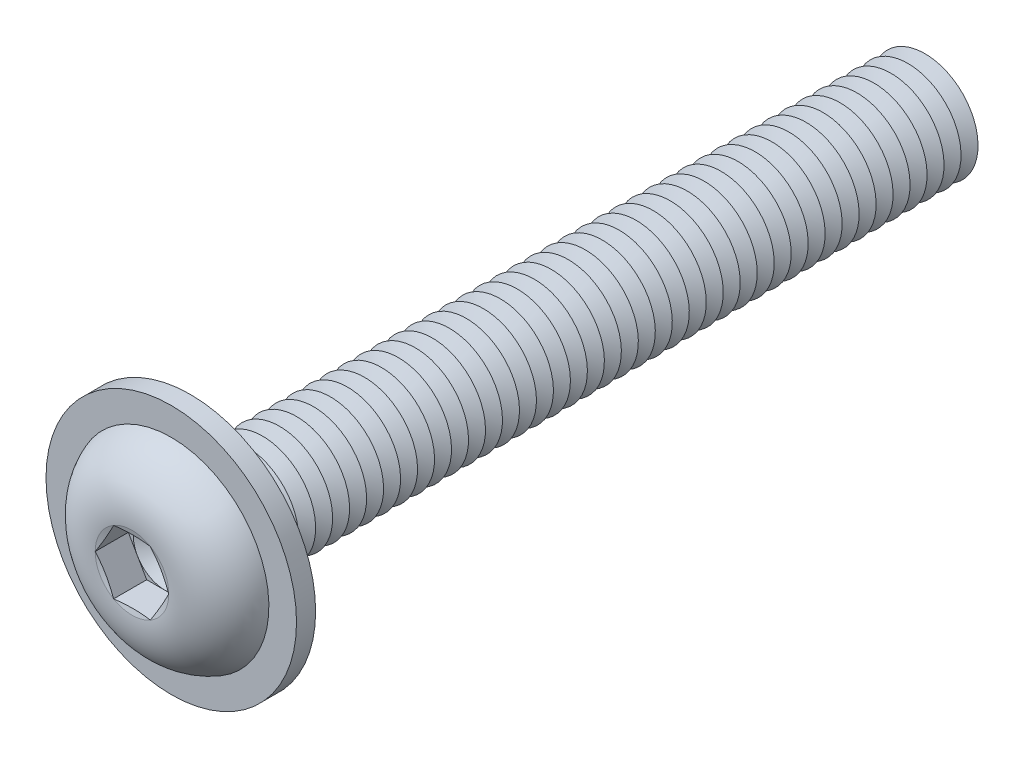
ISO-10303-21;
HEADER;
FILE_DESCRIPTION(('STEP AP214'),'2;1');
FILE_NAME('part.step','',(''),(''),'','','');
FILE_SCHEMA(('AUTOMOTIVE_DESIGN { 1 0 10303 214 1 1 1 1 }'));
ENDSEC;
DATA;
#1=APPLICATION_CONTEXT('core data for automotive mechanical design processes');
#2=APPLICATION_PROTOCOL_DEFINITION('international standard','automotive_design',2000,#1);
#3=PRODUCT_CONTEXT('',#1,'mechanical');
#4=PRODUCT('Part','Part','',(#3));
#5=PRODUCT_RELATED_PRODUCT_CATEGORY('part','',(#4));
#6=PRODUCT_DEFINITION_FORMATION('','',#4);
#7=PRODUCT_DEFINITION_CONTEXT('part definition',#1,'design');
#8=PRODUCT_DEFINITION('design','',#6,#7);
#9=PRODUCT_DEFINITION_SHAPE('','',#8);
#10=(LENGTH_UNIT() NAMED_UNIT(*) SI_UNIT(.MILLI.,.METRE.));
#11=(NAMED_UNIT(*) PLANE_ANGLE_UNIT() SI_UNIT($,.RADIAN.));
#12=(NAMED_UNIT(*) SI_UNIT($,.STERADIAN.) SOLID_ANGLE_UNIT());
#13=UNCERTAINTY_MEASURE_WITH_UNIT(LENGTH_MEASURE(1.E-05),#10,'distance_accuracy_value','');
#14=(GEOMETRIC_REPRESENTATION_CONTEXT(3) GLOBAL_UNCERTAINTY_ASSIGNED_CONTEXT((#13)) GLOBAL_UNIT_ASSIGNED_CONTEXT((#10,
#11,#12)) REPRESENTATION_CONTEXT('',''));
#15=CARTESIAN_POINT('',(0.,0.,0.));
#16=DIRECTION('',(0.,0.,1.));
#17=DIRECTION('',(1.,0.,0.));
#18=AXIS2_PLACEMENT_3D('',#15,#16,#17);
#19=CARTESIAN_POINT('',(0.,0.,-32.2));
#20=DIRECTION('',(0.,0.,1.));
#21=DIRECTION('',(0.,-1.,0.));
#22=AXIS2_PLACEMENT_3D('',#19,#20,#21);
#23=CONICAL_SURFACE('',#22,2.49999999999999,1.0471975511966);
#24=CARTESIAN_POINT('',(0.,0.,-32.6));
#25=DIRECTION('',(0.,0.,1.));
#26=DIRECTION('',(0.,-1.,0.));
#27=AXIS2_PLACEMENT_3D('',#24,#25,#26);
#28=CIRCLE('',#27,1.80717967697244);
#29=CARTESIAN_POINT('',(0.,-1.80717967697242,-32.6));
#30=VERTEX_POINT('',#29);
#31=EDGE_CURVE('E553',#30,#30,#28,.T.);
#32=ORIENTED_EDGE('',*,*,#31,.T.);
#33=EDGE_LOOP('',(#32));
#34=FACE_BOUND('',#33,.T.);
#35=CARTESIAN_POINT('',(0.,0.,-32.2));
#36=DIRECTION('',(0.,0.,1.));
#37=DIRECTION('',(0.,-1.,0.));
#38=AXIS2_PLACEMENT_3D('',#35,#36,#37);
#39=CIRCLE('',#38,2.49999999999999);
#40=CARTESIAN_POINT('',(0.,-2.49999999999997,-32.2));
#41=VERTEX_POINT('',#40);
#42=EDGE_CURVE('E549',#41,#41,#39,.T.);
#43=ORIENTED_EDGE('',*,*,#42,.F.);
#44=EDGE_LOOP('',(#43));
#45=FACE_BOUND('',#44,.T.);
#46=ADVANCED_FACE('F39',(#34,#45),#23,.T.);
#47=CARTESIAN_POINT('',(0.,0.,-32.6));
#48=DIRECTION('',(0.,0.,-1.));
#49=DIRECTION('',(0.,1.,0.));
#50=AXIS2_PLACEMENT_3D('',#47,#48,#49);
#51=CONICAL_SURFACE('',#50,1.80717967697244,1.0471975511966);
#52=CARTESIAN_POINT('',(0.,0.,-33.));
#53=DIRECTION('',(0.,0.,1.));
#54=DIRECTION('',(0.,-1.,0.));
#55=AXIS2_PLACEMENT_3D('',#52,#53,#54);
#56=CIRCLE('',#55,2.49999999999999);
#57=CARTESIAN_POINT('',(0.,-2.49999999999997,-33.));
#58=VERTEX_POINT('',#57);
#59=EDGE_CURVE('E556',#58,#58,#56,.T.);
#60=ORIENTED_EDGE('',*,*,#59,.T.);
#61=EDGE_LOOP('',(#60));
#62=FACE_BOUND('',#61,.T.);
#63=ORIENTED_EDGE('',*,*,#31,.F.);
#64=EDGE_LOOP('',(#63));
#65=FACE_BOUND('',#64,.T.);
#66=ADVANCED_FACE('F677',(#62,#65),#51,.T.);
#67=CARTESIAN_POINT('',(0.,2.5,-35.));
#68=DIRECTION('',(0.,0.,-1.));
#69=DIRECTION('',(0.,1.,0.));
#70=AXIS2_PLACEMENT_3D('',#67,#68,#69);
#71=PLANE('',#70);
#72=CARTESIAN_POINT('',(0.,0.,-35.));
#73=DIRECTION('',(0.,0.,1.));
#74=DIRECTION('',(0.,-1.,0.));
#75=AXIS2_PLACEMENT_3D('',#72,#73,#74);
#76=CIRCLE('',#75,1.80717967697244);
#77=CARTESIAN_POINT('',(0.,-1.80717967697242,-35.));
#78=VERTEX_POINT('',#77);
#79=EDGE_CURVE('E576',#78,#78,#76,.T.);
#80=ORIENTED_EDGE('',*,*,#79,.F.);
#81=EDGE_LOOP('',(#80));
#82=FACE_BOUND('',#81,.T.);
#83=ADVANCED_FACE('F683',(#82),#71,.T.);
#84=CARTESIAN_POINT('',(0.,0.,-34.6));
#85=DIRECTION('',(0.,0.,1.));
#86=DIRECTION('',(0.,-1.,0.));
#87=AXIS2_PLACEMENT_3D('',#84,#85,#86);
#88=CONICAL_SURFACE('',#87,2.49999999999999,1.0471975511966);
#89=ORIENTED_EDGE('',*,*,#79,.T.);
#90=EDGE_LOOP('',(#89));
#91=FACE_BOUND('',#90,.T.);
#92=CARTESIAN_POINT('',(0.,0.,-34.6));
#93=DIRECTION('',(0.,0.,1.));
#94=DIRECTION('',(0.,-1.,0.));
#95=AXIS2_PLACEMENT_3D('',#92,#93,#94);
#96=CIRCLE('',#95,2.49999999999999);
#97=CARTESIAN_POINT('',(0.,-2.49999999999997,-34.6));
#98=VERTEX_POINT('',#97);
#99=EDGE_CURVE('E572',#98,#98,#96,.T.);
#100=ORIENTED_EDGE('',*,*,#99,.F.);
#101=EDGE_LOOP('',(#100));
#102=FACE_BOUND('',#101,.T.);
#103=ADVANCED_FACE('F702',(#91,#102),#88,.T.);
#104=CARTESIAN_POINT('',(0.,0.,-34.2));
#105=DIRECTION('',(0.,0.,-1.));
#106=DIRECTION('',(0.,1.,0.));
#107=AXIS2_PLACEMENT_3D('',#104,#105,#106);
#108=CONICAL_SURFACE('',#107,1.80717967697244,1.0471975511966);
#109=ORIENTED_EDGE('',*,*,#99,.T.);
#110=EDGE_LOOP('',(#109));
#111=FACE_BOUND('',#110,.T.);
#112=CARTESIAN_POINT('',(0.,0.,-34.2));
#113=DIRECTION('',(0.,0.,1.));
#114=DIRECTION('',(0.,-1.,0.));
#115=AXIS2_PLACEMENT_3D('',#112,#113,#114);
#116=CIRCLE('',#115,1.80717967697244);
#117=CARTESIAN_POINT('',(0.,-1.80717967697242,-34.2));
#118=VERTEX_POINT('',#117);
#119=EDGE_CURVE('E568',#118,#118,#116,.T.);
#120=ORIENTED_EDGE('',*,*,#119,.F.);
#121=EDGE_LOOP('',(#120));
#122=FACE_BOUND('',#121,.T.);
#123=ADVANCED_FACE('F699',(#111,#122),#108,.T.);
#124=CARTESIAN_POINT('',(0.,0.,-33.8));
#125=DIRECTION('',(0.,0.,1.));
#126=DIRECTION('',(0.,-1.,0.));
#127=AXIS2_PLACEMENT_3D('',#124,#125,#126);
#128=CONICAL_SURFACE('',#127,2.49999999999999,1.0471975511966);
#129=ORIENTED_EDGE('',*,*,#119,.T.);
#130=EDGE_LOOP('',(#129));
#131=FACE_BOUND('',#130,.T.);
#132=CARTESIAN_POINT('',(0.,0.,-33.8));
#133=DIRECTION('',(0.,0.,1.));
#134=DIRECTION('',(0.,-1.,0.));
#135=AXIS2_PLACEMENT_3D('',#132,#133,#134);
#136=CIRCLE('',#135,2.49999999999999);
#137=CARTESIAN_POINT('',(0.,-2.49999999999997,-33.8));
#138=VERTEX_POINT('',#137);
#139=EDGE_CURVE('E564',#138,#138,#136,.T.);
#140=ORIENTED_EDGE('',*,*,#139,.F.);
#141=EDGE_LOOP('',(#140));
#142=FACE_BOUND('',#141,.T.);
#143=ADVANCED_FACE('F693',(#131,#142),#128,.T.);
#144=CARTESIAN_POINT('',(0.,0.,-33.4));
#145=DIRECTION('',(0.,0.,-1.));
#146=DIRECTION('',(0.,1.,0.));
#147=AXIS2_PLACEMENT_3D('',#144,#145,#146);
#148=CONICAL_SURFACE('',#147,1.80717967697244,1.0471975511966);
#149=ORIENTED_EDGE('',*,*,#139,.T.);
#150=EDGE_LOOP('',(#149));
#151=FACE_BOUND('',#150,.T.);
#152=CARTESIAN_POINT('',(0.,0.,-33.4));
#153=DIRECTION('',(0.,0.,1.));
#154=DIRECTION('',(0.,-1.,0.));
#155=AXIS2_PLACEMENT_3D('',#152,#153,#154);
#156=CIRCLE('',#155,1.80717967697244);
#157=CARTESIAN_POINT('',(0.,-1.80717967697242,-33.4));
#158=VERTEX_POINT('',#157);
#159=EDGE_CURVE('E560',#158,#158,#156,.T.);
#160=ORIENTED_EDGE('',*,*,#159,.F.);
#161=EDGE_LOOP('',(#160));
#162=FACE_BOUND('',#161,.T.);
#163=ADVANCED_FACE('F689',(#151,#162),#148,.T.);
#164=CARTESIAN_POINT('',(0.,0.,-33.));
#165=DIRECTION('',(0.,0.,1.));
#166=DIRECTION('',(0.,-1.,0.));
#167=AXIS2_PLACEMENT_3D('',#164,#165,#166);
#168=CONICAL_SURFACE('',#167,2.49999999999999,1.0471975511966);
#169=ORIENTED_EDGE('',*,*,#159,.T.);
#170=EDGE_LOOP('',(#169));
#171=FACE_BOUND('',#170,.T.);
#172=ORIENTED_EDGE('',*,*,#59,.F.);
#173=EDGE_LOOP('',(#172));
#174=FACE_BOUND('',#173,.T.);
#175=ADVANCED_FACE('F692',(#171,#174),#168,.T.);
#176=CARTESIAN_POINT('',(0.,0.,-31.4));
#177=DIRECTION('',(0.,0.,1.));
#178=DIRECTION('',(0.,-1.,0.));
#179=AXIS2_PLACEMENT_3D('',#176,#177,#178);
#180=CONICAL_SURFACE('',#179,2.49999999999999,1.0471975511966);
#181=CARTESIAN_POINT('',(0.,0.,-31.8));
#182=DIRECTION('',(0.,0.,1.));
#183=DIRECTION('',(0.,-1.,0.));
#184=AXIS2_PLACEMENT_3D('',#181,#182,#183);
#185=CIRCLE('',#184,1.80717967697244);
#186=CARTESIAN_POINT('',(0.,-1.80717967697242,-31.8));
#187=VERTEX_POINT('',#186);
#188=EDGE_CURVE('E545',#187,#187,#185,.T.);
#189=ORIENTED_EDGE('',*,*,#188,.T.);
#190=EDGE_LOOP('',(#189));
#191=FACE_BOUND('',#190,.T.);
#192=CARTESIAN_POINT('',(0.,0.,-31.4));
#193=DIRECTION('',(0.,0.,1.));
#194=DIRECTION('',(0.,-1.,0.));
#195=AXIS2_PLACEMENT_3D('',#192,#193,#194);
#196=CIRCLE('',#195,2.49999999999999);
#197=CARTESIAN_POINT('',(0.,-2.49999999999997,-31.4));
#198=VERTEX_POINT('',#197);
#199=EDGE_CURVE('E541',#198,#198,#196,.T.);
#200=ORIENTED_EDGE('',*,*,#199,.F.);
#201=EDGE_LOOP('',(#200));
#202=FACE_BOUND('',#201,.T.);
#203=ADVANCED_FACE('F697',(#191,#202),#180,.T.);
#204=CARTESIAN_POINT('',(0.,0.,-31.8));
#205=DIRECTION('',(0.,0.,-1.));
#206=DIRECTION('',(0.,1.,0.));
#207=AXIS2_PLACEMENT_3D('',#204,#205,#206);
#208=CONICAL_SURFACE('',#207,1.80717967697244,1.0471975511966);
#209=ORIENTED_EDGE('',*,*,#42,.T.);
#210=EDGE_LOOP('',(#209));
#211=FACE_BOUND('',#210,.T.);
#212=ORIENTED_EDGE('',*,*,#188,.F.);
#213=EDGE_LOOP('',(#212));
#214=FACE_BOUND('',#213,.T.);
#215=ADVANCED_FACE('F748',(#211,#214),#208,.T.);
#216=CARTESIAN_POINT('',(0.,0.,-30.6));
#217=DIRECTION('',(0.,0.,1.));
#218=DIRECTION('',(0.,-1.,0.));
#219=AXIS2_PLACEMENT_3D('',#216,#217,#218);
#220=CONICAL_SURFACE('',#219,2.49999999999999,1.0471975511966);
#221=CARTESIAN_POINT('',(0.,0.,-31.));
#222=DIRECTION('',(0.,0.,1.));
#223=DIRECTION('',(0.,-1.,0.));
#224=AXIS2_PLACEMENT_3D('',#221,#222,#223);
#225=CIRCLE('',#224,1.80717967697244);
#226=CARTESIAN_POINT('',(0.,-1.80717967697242,-31.));
#227=VERTEX_POINT('',#226);
#228=EDGE_CURVE('E537',#227,#227,#225,.T.);
#229=ORIENTED_EDGE('',*,*,#228,.T.);
#230=EDGE_LOOP('',(#229));
#231=FACE_BOUND('',#230,.T.);
#232=CARTESIAN_POINT('',(0.,0.,-30.6));
#233=DIRECTION('',(0.,0.,1.));
#234=DIRECTION('',(0.,-1.,0.));
#235=AXIS2_PLACEMENT_3D('',#232,#233,#234);
#236=CIRCLE('',#235,2.49999999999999);
#237=CARTESIAN_POINT('',(0.,-2.49999999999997,-30.6));
#238=VERTEX_POINT('',#237);
#239=EDGE_CURVE('E533',#238,#238,#236,.T.);
#240=ORIENTED_EDGE('',*,*,#239,.F.);
#241=EDGE_LOOP('',(#240));
#242=FACE_BOUND('',#241,.T.);
#243=ADVANCED_FACE('F754',(#231,#242),#220,.T.);
#244=CARTESIAN_POINT('',(0.,0.,-31.));
#245=DIRECTION('',(0.,0.,-1.));
#246=DIRECTION('',(0.,1.,0.));
#247=AXIS2_PLACEMENT_3D('',#244,#245,#246);
#248=CONICAL_SURFACE('',#247,1.80717967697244,1.0471975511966);
#249=ORIENTED_EDGE('',*,*,#199,.T.);
#250=EDGE_LOOP('',(#249));
#251=FACE_BOUND('',#250,.T.);
#252=ORIENTED_EDGE('',*,*,#228,.F.);
#253=EDGE_LOOP('',(#252));
#254=FACE_BOUND('',#253,.T.);
#255=ADVANCED_FACE('F761',(#251,#254),#248,.T.);
#256=CARTESIAN_POINT('',(0.,0.,-29.8));
#257=DIRECTION('',(0.,0.,1.));
#258=DIRECTION('',(0.,-1.,0.));
#259=AXIS2_PLACEMENT_3D('',#256,#257,#258);
#260=CONICAL_SURFACE('',#259,2.49999999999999,1.0471975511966);
#261=CARTESIAN_POINT('',(0.,0.,-30.2));
#262=DIRECTION('',(0.,0.,1.));
#263=DIRECTION('',(0.,-1.,0.));
#264=AXIS2_PLACEMENT_3D('',#261,#262,#263);
#265=CIRCLE('',#264,1.80717967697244);
#266=CARTESIAN_POINT('',(0.,-1.80717967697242,-30.2));
#267=VERTEX_POINT('',#266);
#268=EDGE_CURVE('E529',#267,#267,#265,.T.);
#269=ORIENTED_EDGE('',*,*,#268,.T.);
#270=EDGE_LOOP('',(#269));
#271=FACE_BOUND('',#270,.T.);
#272=CARTESIAN_POINT('',(0.,0.,-29.8));
#273=DIRECTION('',(0.,0.,1.));
#274=DIRECTION('',(0.,-1.,0.));
#275=AXIS2_PLACEMENT_3D('',#272,#273,#274);
#276=CIRCLE('',#275,2.49999999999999);
#277=CARTESIAN_POINT('',(0.,-2.49999999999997,-29.8));
#278=VERTEX_POINT('',#277);
#279=EDGE_CURVE('E525',#278,#278,#276,.T.);
#280=ORIENTED_EDGE('',*,*,#279,.F.);
#281=EDGE_LOOP('',(#280));
#282=FACE_BOUND('',#281,.T.);
#283=ADVANCED_FACE('F768',(#271,#282),#260,.T.);
#284=CARTESIAN_POINT('',(0.,0.,-30.2));
#285=DIRECTION('',(0.,0.,-1.));
#286=DIRECTION('',(0.,1.,0.));
#287=AXIS2_PLACEMENT_3D('',#284,#285,#286);
#288=CONICAL_SURFACE('',#287,1.80717967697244,1.0471975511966);
#289=ORIENTED_EDGE('',*,*,#239,.T.);
#290=EDGE_LOOP('',(#289));
#291=FACE_BOUND('',#290,.T.);
#292=ORIENTED_EDGE('',*,*,#268,.F.);
#293=EDGE_LOOP('',(#292));
#294=FACE_BOUND('',#293,.T.);
#295=ADVANCED_FACE('F775',(#291,#294),#288,.T.);
#296=CARTESIAN_POINT('',(0.,0.,-29.));
#297=DIRECTION('',(0.,0.,1.));
#298=DIRECTION('',(0.,-1.,0.));
#299=AXIS2_PLACEMENT_3D('',#296,#297,#298);
#300=CONICAL_SURFACE('',#299,2.49999999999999,1.0471975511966);
#301=CARTESIAN_POINT('',(0.,0.,-29.4));
#302=DIRECTION('',(0.,0.,1.));
#303=DIRECTION('',(0.,-1.,0.));
#304=AXIS2_PLACEMENT_3D('',#301,#302,#303);
#305=CIRCLE('',#304,1.80717967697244);
#306=CARTESIAN_POINT('',(0.,-1.80717967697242,-29.4));
#307=VERTEX_POINT('',#306);
#308=EDGE_CURVE('E521',#307,#307,#305,.T.);
#309=ORIENTED_EDGE('',*,*,#308,.T.);
#310=EDGE_LOOP('',(#309));
#311=FACE_BOUND('',#310,.T.);
#312=CARTESIAN_POINT('',(0.,0.,-29.));
#313=DIRECTION('',(0.,0.,1.));
#314=DIRECTION('',(0.,-1.,0.));
#315=AXIS2_PLACEMENT_3D('',#312,#313,#314);
#316=CIRCLE('',#315,2.49999999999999);
#317=CARTESIAN_POINT('',(0.,-2.49999999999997,-29.));
#318=VERTEX_POINT('',#317);
#319=EDGE_CURVE('E517',#318,#318,#316,.T.);
#320=ORIENTED_EDGE('',*,*,#319,.F.);
#321=EDGE_LOOP('',(#320));
#322=FACE_BOUND('',#321,.T.);
#323=ADVANCED_FACE('F782',(#311,#322),#300,.T.);
#324=CARTESIAN_POINT('',(0.,0.,-29.4));
#325=DIRECTION('',(0.,0.,-1.));
#326=DIRECTION('',(0.,1.,0.));
#327=AXIS2_PLACEMENT_3D('',#324,#325,#326);
#328=CONICAL_SURFACE('',#327,1.80717967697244,1.0471975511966);
#329=ORIENTED_EDGE('',*,*,#279,.T.);
#330=EDGE_LOOP('',(#329));
#331=FACE_BOUND('',#330,.T.);
#332=ORIENTED_EDGE('',*,*,#308,.F.);
#333=EDGE_LOOP('',(#332));
#334=FACE_BOUND('',#333,.T.);
#335=ADVANCED_FACE('F789',(#331,#334),#328,.T.);
#336=CARTESIAN_POINT('',(0.,0.,-28.2));
#337=DIRECTION('',(0.,0.,1.));
#338=DIRECTION('',(0.,-1.,0.));
#339=AXIS2_PLACEMENT_3D('',#336,#337,#338);
#340=CONICAL_SURFACE('',#339,2.49999999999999,1.0471975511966);
#341=CARTESIAN_POINT('',(0.,0.,-28.6));
#342=DIRECTION('',(0.,0.,1.));
#343=DIRECTION('',(0.,-1.,0.));
#344=AXIS2_PLACEMENT_3D('',#341,#342,#343);
#345=CIRCLE('',#344,1.80717967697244);
#346=CARTESIAN_POINT('',(0.,-1.80717967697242,-28.6));
#347=VERTEX_POINT('',#346);
#348=EDGE_CURVE('E513',#347,#347,#345,.T.);
#349=ORIENTED_EDGE('',*,*,#348,.T.);
#350=EDGE_LOOP('',(#349));
#351=FACE_BOUND('',#350,.T.);
#352=CARTESIAN_POINT('',(0.,0.,-28.2));
#353=DIRECTION('',(0.,0.,1.));
#354=DIRECTION('',(0.,-1.,0.));
#355=AXIS2_PLACEMENT_3D('',#352,#353,#354);
#356=CIRCLE('',#355,2.49999999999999);
#357=CARTESIAN_POINT('',(0.,-2.49999999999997,-28.2));
#358=VERTEX_POINT('',#357);
#359=EDGE_CURVE('E509',#358,#358,#356,.T.);
#360=ORIENTED_EDGE('',*,*,#359,.F.);
#361=EDGE_LOOP('',(#360));
#362=FACE_BOUND('',#361,.T.);
#363=ADVANCED_FACE('F796',(#351,#362),#340,.T.);
#364=CARTESIAN_POINT('',(0.,0.,-28.6));
#365=DIRECTION('',(0.,0.,-1.));
#366=DIRECTION('',(0.,1.,0.));
#367=AXIS2_PLACEMENT_3D('',#364,#365,#366);
#368=CONICAL_SURFACE('',#367,1.80717967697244,1.0471975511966);
#369=ORIENTED_EDGE('',*,*,#319,.T.);
#370=EDGE_LOOP('',(#369));
#371=FACE_BOUND('',#370,.T.);
#372=ORIENTED_EDGE('',*,*,#348,.F.);
#373=EDGE_LOOP('',(#372));
#374=FACE_BOUND('',#373,.T.);
#375=ADVANCED_FACE('F803',(#371,#374),#368,.T.);
#376=CARTESIAN_POINT('',(0.,0.,-27.4));
#377=DIRECTION('',(0.,0.,1.));
#378=DIRECTION('',(0.,-1.,0.));
#379=AXIS2_PLACEMENT_3D('',#376,#377,#378);
#380=CONICAL_SURFACE('',#379,2.49999999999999,1.0471975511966);
#381=CARTESIAN_POINT('',(0.,0.,-27.8));
#382=DIRECTION('',(0.,0.,1.));
#383=DIRECTION('',(0.,-1.,0.));
#384=AXIS2_PLACEMENT_3D('',#381,#382,#383);
#385=CIRCLE('',#384,1.80717967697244);
#386=CARTESIAN_POINT('',(0.,-1.80717967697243,-27.8));
#387=VERTEX_POINT('',#386);
#388=EDGE_CURVE('E505',#387,#387,#385,.T.);
#389=ORIENTED_EDGE('',*,*,#388,.T.);
#390=EDGE_LOOP('',(#389));
#391=FACE_BOUND('',#390,.T.);
#392=CARTESIAN_POINT('',(0.,0.,-27.4));
#393=DIRECTION('',(0.,0.,1.));
#394=DIRECTION('',(0.,-1.,0.));
#395=AXIS2_PLACEMENT_3D('',#392,#393,#394);
#396=CIRCLE('',#395,2.49999999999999);
#397=CARTESIAN_POINT('',(0.,-2.49999999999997,-27.4));
#398=VERTEX_POINT('',#397);
#399=EDGE_CURVE('E501',#398,#398,#396,.T.);
#400=ORIENTED_EDGE('',*,*,#399,.F.);
#401=EDGE_LOOP('',(#400));
#402=FACE_BOUND('',#401,.T.);
#403=ADVANCED_FACE('F810',(#391,#402),#380,.T.);
#404=CARTESIAN_POINT('',(0.,0.,-27.8));
#405=DIRECTION('',(0.,0.,-1.));
#406=DIRECTION('',(0.,1.,0.));
#407=AXIS2_PLACEMENT_3D('',#404,#405,#406);
#408=CONICAL_SURFACE('',#407,1.80717967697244,1.0471975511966);
#409=ORIENTED_EDGE('',*,*,#359,.T.);
#410=EDGE_LOOP('',(#409));
#411=FACE_BOUND('',#410,.T.);
#412=ORIENTED_EDGE('',*,*,#388,.F.);
#413=EDGE_LOOP('',(#412));
#414=FACE_BOUND('',#413,.T.);
#415=ADVANCED_FACE('F817',(#411,#414),#408,.T.);
#416=CARTESIAN_POINT('',(0.,0.,-26.6));
#417=DIRECTION('',(0.,0.,1.));
#418=DIRECTION('',(0.,-1.,0.));
#419=AXIS2_PLACEMENT_3D('',#416,#417,#418);
#420=CONICAL_SURFACE('',#419,2.49999999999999,1.0471975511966);
#421=CARTESIAN_POINT('',(0.,0.,-27.));
#422=DIRECTION('',(0.,0.,1.));
#423=DIRECTION('',(0.,-1.,0.));
#424=AXIS2_PLACEMENT_3D('',#421,#422,#423);
#425=CIRCLE('',#424,1.80717967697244);
#426=CARTESIAN_POINT('',(0.,-1.80717967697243,-27.));
#427=VERTEX_POINT('',#426);
#428=EDGE_CURVE('E497',#427,#427,#425,.T.);
#429=ORIENTED_EDGE('',*,*,#428,.T.);
#430=EDGE_LOOP('',(#429));
#431=FACE_BOUND('',#430,.T.);
#432=CARTESIAN_POINT('',(0.,0.,-26.6));
#433=DIRECTION('',(0.,0.,1.));
#434=DIRECTION('',(0.,-1.,0.));
#435=AXIS2_PLACEMENT_3D('',#432,#433,#434);
#436=CIRCLE('',#435,2.49999999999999);
#437=CARTESIAN_POINT('',(0.,-2.49999999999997,-26.6));
#438=VERTEX_POINT('',#437);
#439=EDGE_CURVE('E493',#438,#438,#436,.T.);
#440=ORIENTED_EDGE('',*,*,#439,.F.);
#441=EDGE_LOOP('',(#440));
#442=FACE_BOUND('',#441,.T.);
#443=ADVANCED_FACE('F824',(#431,#442),#420,.T.);
#444=CARTESIAN_POINT('',(0.,0.,-27.));
#445=DIRECTION('',(0.,0.,-1.));
#446=DIRECTION('',(0.,1.,0.));
#447=AXIS2_PLACEMENT_3D('',#444,#445,#446);
#448=CONICAL_SURFACE('',#447,1.80717967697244,1.0471975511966);
#449=ORIENTED_EDGE('',*,*,#399,.T.);
#450=EDGE_LOOP('',(#449));
#451=FACE_BOUND('',#450,.T.);
#452=ORIENTED_EDGE('',*,*,#428,.F.);
#453=EDGE_LOOP('',(#452));
#454=FACE_BOUND('',#453,.T.);
#455=ADVANCED_FACE('F831',(#451,#454),#448,.T.);
#456=CARTESIAN_POINT('',(0.,0.,-25.8));
#457=DIRECTION('',(0.,0.,1.));
#458=DIRECTION('',(0.,-1.,0.));
#459=AXIS2_PLACEMENT_3D('',#456,#457,#458);
#460=CONICAL_SURFACE('',#459,2.49999999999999,1.0471975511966);
#461=CARTESIAN_POINT('',(0.,0.,-26.2));
#462=DIRECTION('',(0.,0.,1.));
#463=DIRECTION('',(0.,-1.,0.));
#464=AXIS2_PLACEMENT_3D('',#461,#462,#463);
#465=CIRCLE('',#464,1.80717967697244);
#466=CARTESIAN_POINT('',(0.,-1.80717967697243,-26.2));
#467=VERTEX_POINT('',#466);
#468=EDGE_CURVE('E489',#467,#467,#465,.T.);
#469=ORIENTED_EDGE('',*,*,#468,.T.);
#470=EDGE_LOOP('',(#469));
#471=FACE_BOUND('',#470,.T.);
#472=CARTESIAN_POINT('',(0.,0.,-25.8));
#473=DIRECTION('',(0.,0.,1.));
#474=DIRECTION('',(0.,-1.,0.));
#475=AXIS2_PLACEMENT_3D('',#472,#473,#474);
#476=CIRCLE('',#475,2.49999999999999);
#477=CARTESIAN_POINT('',(0.,-2.49999999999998,-25.8));
#478=VERTEX_POINT('',#477);
#479=EDGE_CURVE('E485',#478,#478,#476,.T.);
#480=ORIENTED_EDGE('',*,*,#479,.F.);
#481=EDGE_LOOP('',(#480));
#482=FACE_BOUND('',#481,.T.);
#483=ADVANCED_FACE('F838',(#471,#482),#460,.T.);
#484=CARTESIAN_POINT('',(0.,0.,-26.2));
#485=DIRECTION('',(0.,0.,-1.));
#486=DIRECTION('',(0.,1.,0.));
#487=AXIS2_PLACEMENT_3D('',#484,#485,#486);
#488=CONICAL_SURFACE('',#487,1.80717967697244,1.0471975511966);
#489=ORIENTED_EDGE('',*,*,#439,.T.);
#490=EDGE_LOOP('',(#489));
#491=FACE_BOUND('',#490,.T.);
#492=ORIENTED_EDGE('',*,*,#468,.F.);
#493=EDGE_LOOP('',(#492));
#494=FACE_BOUND('',#493,.T.);
#495=ADVANCED_FACE('F845',(#491,#494),#488,.T.);
#496=CARTESIAN_POINT('',(0.,0.,-25.));
#497=DIRECTION('',(0.,0.,1.));
#498=DIRECTION('',(0.,-1.,0.));
#499=AXIS2_PLACEMENT_3D('',#496,#497,#498);
#500=CONICAL_SURFACE('',#499,2.49999999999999,1.0471975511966);
#501=CARTESIAN_POINT('',(0.,0.,-25.4));
#502=DIRECTION('',(0.,0.,1.));
#503=DIRECTION('',(0.,-1.,0.));
#504=AXIS2_PLACEMENT_3D('',#501,#502,#503);
#505=CIRCLE('',#504,1.80717967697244);
#506=CARTESIAN_POINT('',(0.,-1.80717967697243,-25.4));
#507=VERTEX_POINT('',#506);
#508=EDGE_CURVE('E481',#507,#507,#505,.T.);
#509=ORIENTED_EDGE('',*,*,#508,.T.);
#510=EDGE_LOOP('',(#509));
#511=FACE_BOUND('',#510,.T.);
#512=CARTESIAN_POINT('',(0.,0.,-25.));
#513=DIRECTION('',(0.,0.,1.));
#514=DIRECTION('',(0.,-1.,0.));
#515=AXIS2_PLACEMENT_3D('',#512,#513,#514);
#516=CIRCLE('',#515,2.49999999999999);
#517=CARTESIAN_POINT('',(0.,-2.49999999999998,-25.));
#518=VERTEX_POINT('',#517);
#519=EDGE_CURVE('E477',#518,#518,#516,.T.);
#520=ORIENTED_EDGE('',*,*,#519,.F.);
#521=EDGE_LOOP('',(#520));
#522=FACE_BOUND('',#521,.T.);
#523=ADVANCED_FACE('F852',(#511,#522),#500,.T.);
#524=CARTESIAN_POINT('',(0.,0.,-25.4));
#525=DIRECTION('',(0.,0.,-1.));
#526=DIRECTION('',(0.,1.,0.));
#527=AXIS2_PLACEMENT_3D('',#524,#525,#526);
#528=CONICAL_SURFACE('',#527,1.80717967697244,1.0471975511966);
#529=ORIENTED_EDGE('',*,*,#479,.T.);
#530=EDGE_LOOP('',(#529));
#531=FACE_BOUND('',#530,.T.);
#532=ORIENTED_EDGE('',*,*,#508,.F.);
#533=EDGE_LOOP('',(#532));
#534=FACE_BOUND('',#533,.T.);
#535=ADVANCED_FACE('F859',(#531,#534),#528,.T.);
#536=CARTESIAN_POINT('',(0.,0.,-24.2));
#537=DIRECTION('',(0.,0.,1.));
#538=DIRECTION('',(0.,-1.,0.));
#539=AXIS2_PLACEMENT_3D('',#536,#537,#538);
#540=CONICAL_SURFACE('',#539,2.49999999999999,1.0471975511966);
#541=CARTESIAN_POINT('',(0.,0.,-24.6));
#542=DIRECTION('',(0.,0.,1.));
#543=DIRECTION('',(0.,-1.,0.));
#544=AXIS2_PLACEMENT_3D('',#541,#542,#543);
#545=CIRCLE('',#544,1.80717967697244);
#546=CARTESIAN_POINT('',(0.,-1.80717967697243,-24.6));
#547=VERTEX_POINT('',#546);
#548=EDGE_CURVE('E473',#547,#547,#545,.T.);
#549=ORIENTED_EDGE('',*,*,#548,.T.);
#550=EDGE_LOOP('',(#549));
#551=FACE_BOUND('',#550,.T.);
#552=CARTESIAN_POINT('',(0.,0.,-24.2));
#553=DIRECTION('',(0.,0.,1.));
#554=DIRECTION('',(0.,-1.,0.));
#555=AXIS2_PLACEMENT_3D('',#552,#553,#554);
#556=CIRCLE('',#555,2.49999999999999);
#557=CARTESIAN_POINT('',(0.,-2.49999999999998,-24.2));
#558=VERTEX_POINT('',#557);
#559=EDGE_CURVE('E469',#558,#558,#556,.T.);
#560=ORIENTED_EDGE('',*,*,#559,.F.);
#561=EDGE_LOOP('',(#560));
#562=FACE_BOUND('',#561,.T.);
#563=ADVANCED_FACE('F866',(#551,#562),#540,.T.);
#564=CARTESIAN_POINT('',(0.,0.,-24.6));
#565=DIRECTION('',(0.,0.,-1.));
#566=DIRECTION('',(0.,1.,0.));
#567=AXIS2_PLACEMENT_3D('',#564,#565,#566);
#568=CONICAL_SURFACE('',#567,1.80717967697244,1.0471975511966);
#569=ORIENTED_EDGE('',*,*,#519,.T.);
#570=EDGE_LOOP('',(#569));
#571=FACE_BOUND('',#570,.T.);
#572=ORIENTED_EDGE('',*,*,#548,.F.);
#573=EDGE_LOOP('',(#572));
#574=FACE_BOUND('',#573,.T.);
#575=ADVANCED_FACE('F873',(#571,#574),#568,.T.);
#576=CARTESIAN_POINT('',(0.,0.,-23.4));
#577=DIRECTION('',(0.,0.,1.));
#578=DIRECTION('',(0.,-1.,0.));
#579=AXIS2_PLACEMENT_3D('',#576,#577,#578);
#580=CONICAL_SURFACE('',#579,2.49999999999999,1.0471975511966);
#581=CARTESIAN_POINT('',(0.,0.,-23.8));
#582=DIRECTION('',(0.,0.,1.));
#583=DIRECTION('',(0.,-1.,0.));
#584=AXIS2_PLACEMENT_3D('',#581,#582,#583);
#585=CIRCLE('',#584,1.80717967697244);
#586=CARTESIAN_POINT('',(0.,-1.80717967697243,-23.8));
#587=VERTEX_POINT('',#586);
#588=EDGE_CURVE('E465',#587,#587,#585,.T.);
#589=ORIENTED_EDGE('',*,*,#588,.T.);
#590=EDGE_LOOP('',(#589));
#591=FACE_BOUND('',#590,.T.);
#592=CARTESIAN_POINT('',(0.,0.,-23.4));
#593=DIRECTION('',(0.,0.,1.));
#594=DIRECTION('',(0.,-1.,0.));
#595=AXIS2_PLACEMENT_3D('',#592,#593,#594);
#596=CIRCLE('',#595,2.49999999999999);
#597=CARTESIAN_POINT('',(0.,-2.49999999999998,-23.4));
#598=VERTEX_POINT('',#597);
#599=EDGE_CURVE('E461',#598,#598,#596,.T.);
#600=ORIENTED_EDGE('',*,*,#599,.F.);
#601=EDGE_LOOP('',(#600));
#602=FACE_BOUND('',#601,.T.);
#603=ADVANCED_FACE('F880',(#591,#602),#580,.T.);
#604=CARTESIAN_POINT('',(0.,0.,-23.8));
#605=DIRECTION('',(0.,0.,-1.));
#606=DIRECTION('',(0.,1.,0.));
#607=AXIS2_PLACEMENT_3D('',#604,#605,#606);
#608=CONICAL_SURFACE('',#607,1.80717967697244,1.0471975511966);
#609=ORIENTED_EDGE('',*,*,#559,.T.);
#610=EDGE_LOOP('',(#609));
#611=FACE_BOUND('',#610,.T.);
#612=ORIENTED_EDGE('',*,*,#588,.F.);
#613=EDGE_LOOP('',(#612));
#614=FACE_BOUND('',#613,.T.);
#615=ADVANCED_FACE('F887',(#611,#614),#608,.T.);
#616=CARTESIAN_POINT('',(0.,0.,-22.6));
#617=DIRECTION('',(0.,0.,1.));
#618=DIRECTION('',(0.,-1.,0.));
#619=AXIS2_PLACEMENT_3D('',#616,#617,#618);
#620=CONICAL_SURFACE('',#619,2.49999999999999,1.0471975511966);
#621=CARTESIAN_POINT('',(0.,0.,-23.));
#622=DIRECTION('',(0.,0.,1.));
#623=DIRECTION('',(0.,-1.,0.));
#624=AXIS2_PLACEMENT_3D('',#621,#622,#623);
#625=CIRCLE('',#624,1.80717967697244);
#626=CARTESIAN_POINT('',(0.,-1.80717967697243,-23.));
#627=VERTEX_POINT('',#626);
#628=EDGE_CURVE('E457',#627,#627,#625,.T.);
#629=ORIENTED_EDGE('',*,*,#628,.T.);
#630=EDGE_LOOP('',(#629));
#631=FACE_BOUND('',#630,.T.);
#632=CARTESIAN_POINT('',(0.,0.,-22.6));
#633=DIRECTION('',(0.,0.,1.));
#634=DIRECTION('',(0.,-1.,0.));
#635=AXIS2_PLACEMENT_3D('',#632,#633,#634);
#636=CIRCLE('',#635,2.49999999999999);
#637=CARTESIAN_POINT('',(0.,-2.49999999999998,-22.6));
#638=VERTEX_POINT('',#637);
#639=EDGE_CURVE('E453',#638,#638,#636,.T.);
#640=ORIENTED_EDGE('',*,*,#639,.F.);
#641=EDGE_LOOP('',(#640));
#642=FACE_BOUND('',#641,.T.);
#643=ADVANCED_FACE('F894',(#631,#642),#620,.T.);
#644=CARTESIAN_POINT('',(0.,0.,-23.));
#645=DIRECTION('',(0.,0.,-1.));
#646=DIRECTION('',(0.,1.,0.));
#647=AXIS2_PLACEMENT_3D('',#644,#645,#646);
#648=CONICAL_SURFACE('',#647,1.80717967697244,1.0471975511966);
#649=ORIENTED_EDGE('',*,*,#599,.T.);
#650=EDGE_LOOP('',(#649));
#651=FACE_BOUND('',#650,.T.);
#652=ORIENTED_EDGE('',*,*,#628,.F.);
#653=EDGE_LOOP('',(#652));
#654=FACE_BOUND('',#653,.T.);
#655=ADVANCED_FACE('F901',(#651,#654),#648,.T.);
#656=CARTESIAN_POINT('',(0.,0.,-21.8));
#657=DIRECTION('',(0.,0.,1.));
#658=DIRECTION('',(0.,-1.,0.));
#659=AXIS2_PLACEMENT_3D('',#656,#657,#658);
#660=CONICAL_SURFACE('',#659,2.49999999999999,1.0471975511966);
#661=CARTESIAN_POINT('',(0.,0.,-22.2));
#662=DIRECTION('',(0.,0.,1.));
#663=DIRECTION('',(0.,-1.,0.));
#664=AXIS2_PLACEMENT_3D('',#661,#662,#663);
#665=CIRCLE('',#664,1.80717967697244);
#666=CARTESIAN_POINT('',(0.,-1.80717967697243,-22.2));
#667=VERTEX_POINT('',#666);
#668=EDGE_CURVE('E449',#667,#667,#665,.T.);
#669=ORIENTED_EDGE('',*,*,#668,.T.);
#670=EDGE_LOOP('',(#669));
#671=FACE_BOUND('',#670,.T.);
#672=CARTESIAN_POINT('',(0.,0.,-21.8));
#673=DIRECTION('',(0.,0.,1.));
#674=DIRECTION('',(0.,-1.,0.));
#675=AXIS2_PLACEMENT_3D('',#672,#673,#674);
#676=CIRCLE('',#675,2.49999999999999);
#677=CARTESIAN_POINT('',(0.,-2.49999999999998,-21.8));
#678=VERTEX_POINT('',#677);
#679=EDGE_CURVE('E445',#678,#678,#676,.T.);
#680=ORIENTED_EDGE('',*,*,#679,.F.);
#681=EDGE_LOOP('',(#680));
#682=FACE_BOUND('',#681,.T.);
#683=ADVANCED_FACE('F908',(#671,#682),#660,.T.);
#684=CARTESIAN_POINT('',(0.,0.,-22.2));
#685=DIRECTION('',(0.,0.,-1.));
#686=DIRECTION('',(0.,1.,0.));
#687=AXIS2_PLACEMENT_3D('',#684,#685,#686);
#688=CONICAL_SURFACE('',#687,1.80717967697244,1.0471975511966);
#689=ORIENTED_EDGE('',*,*,#639,.T.);
#690=EDGE_LOOP('',(#689));
#691=FACE_BOUND('',#690,.T.);
#692=ORIENTED_EDGE('',*,*,#668,.F.);
#693=EDGE_LOOP('',(#692));
#694=FACE_BOUND('',#693,.T.);
#695=ADVANCED_FACE('F915',(#691,#694),#688,.T.);
#696=CARTESIAN_POINT('',(0.,0.,-21.));
#697=DIRECTION('',(0.,0.,1.));
#698=DIRECTION('',(0.,-1.,0.));
#699=AXIS2_PLACEMENT_3D('',#696,#697,#698);
#700=CONICAL_SURFACE('',#699,2.49999999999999,1.0471975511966);
#701=CARTESIAN_POINT('',(0.,0.,-21.4));
#702=DIRECTION('',(0.,0.,1.));
#703=DIRECTION('',(0.,-1.,0.));
#704=AXIS2_PLACEMENT_3D('',#701,#702,#703);
#705=CIRCLE('',#704,1.80717967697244);
#706=CARTESIAN_POINT('',(0.,-1.80717967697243,-21.4));
#707=VERTEX_POINT('',#706);
#708=EDGE_CURVE('E441',#707,#707,#705,.T.);
#709=ORIENTED_EDGE('',*,*,#708,.T.);
#710=EDGE_LOOP('',(#709));
#711=FACE_BOUND('',#710,.T.);
#712=CARTESIAN_POINT('',(0.,0.,-21.));
#713=DIRECTION('',(0.,0.,1.));
#714=DIRECTION('',(0.,-1.,0.));
#715=AXIS2_PLACEMENT_3D('',#712,#713,#714);
#716=CIRCLE('',#715,2.49999999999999);
#717=CARTESIAN_POINT('',(0.,-2.49999999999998,-21.));
#718=VERTEX_POINT('',#717);
#719=EDGE_CURVE('E437',#718,#718,#716,.T.);
#720=ORIENTED_EDGE('',*,*,#719,.F.);
#721=EDGE_LOOP('',(#720));
#722=FACE_BOUND('',#721,.T.);
#723=ADVANCED_FACE('F922',(#711,#722),#700,.T.);
#724=CARTESIAN_POINT('',(0.,0.,-21.4));
#725=DIRECTION('',(0.,0.,-1.));
#726=DIRECTION('',(0.,1.,0.));
#727=AXIS2_PLACEMENT_3D('',#724,#725,#726);
#728=CONICAL_SURFACE('',#727,1.80717967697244,1.0471975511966);
#729=ORIENTED_EDGE('',*,*,#679,.T.);
#730=EDGE_LOOP('',(#729));
#731=FACE_BOUND('',#730,.T.);
#732=ORIENTED_EDGE('',*,*,#708,.F.);
#733=EDGE_LOOP('',(#732));
#734=FACE_BOUND('',#733,.T.);
#735=ADVANCED_FACE('F929',(#731,#734),#728,.T.);
#736=CARTESIAN_POINT('',(0.,0.,-20.2));
#737=DIRECTION('',(0.,0.,1.));
#738=DIRECTION('',(0.,-1.,0.));
#739=AXIS2_PLACEMENT_3D('',#736,#737,#738);
#740=CONICAL_SURFACE('',#739,2.49999999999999,1.0471975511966);
#741=CARTESIAN_POINT('',(0.,0.,-20.6));
#742=DIRECTION('',(0.,0.,1.));
#743=DIRECTION('',(0.,-1.,0.));
#744=AXIS2_PLACEMENT_3D('',#741,#742,#743);
#745=CIRCLE('',#744,1.80717967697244);
#746=CARTESIAN_POINT('',(0.,-1.80717967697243,-20.6));
#747=VERTEX_POINT('',#746);
#748=EDGE_CURVE('E433',#747,#747,#745,.T.);
#749=ORIENTED_EDGE('',*,*,#748,.T.);
#750=EDGE_LOOP('',(#749));
#751=FACE_BOUND('',#750,.T.);
#752=CARTESIAN_POINT('',(0.,0.,-20.2));
#753=DIRECTION('',(0.,0.,1.));
#754=DIRECTION('',(0.,-1.,0.));
#755=AXIS2_PLACEMENT_3D('',#752,#753,#754);
#756=CIRCLE('',#755,2.49999999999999);
#757=CARTESIAN_POINT('',(0.,-2.49999999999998,-20.2));
#758=VERTEX_POINT('',#757);
#759=EDGE_CURVE('E429',#758,#758,#756,.T.);
#760=ORIENTED_EDGE('',*,*,#759,.F.);
#761=EDGE_LOOP('',(#760));
#762=FACE_BOUND('',#761,.T.);
#763=ADVANCED_FACE('F936',(#751,#762),#740,.T.);
#764=CARTESIAN_POINT('',(0.,0.,-20.6));
#765=DIRECTION('',(0.,0.,-1.));
#766=DIRECTION('',(0.,1.,0.));
#767=AXIS2_PLACEMENT_3D('',#764,#765,#766);
#768=CONICAL_SURFACE('',#767,1.80717967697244,1.0471975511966);
#769=ORIENTED_EDGE('',*,*,#719,.T.);
#770=EDGE_LOOP('',(#769));
#771=FACE_BOUND('',#770,.T.);
#772=ORIENTED_EDGE('',*,*,#748,.F.);
#773=EDGE_LOOP('',(#772));
#774=FACE_BOUND('',#773,.T.);
#775=ADVANCED_FACE('F943',(#771,#774),#768,.T.);
#776=CARTESIAN_POINT('',(0.,0.,-19.4));
#777=DIRECTION('',(0.,0.,1.));
#778=DIRECTION('',(0.,-1.,0.));
#779=AXIS2_PLACEMENT_3D('',#776,#777,#778);
#780=CONICAL_SURFACE('',#779,2.49999999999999,1.0471975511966);
#781=CARTESIAN_POINT('',(0.,0.,-19.8));
#782=DIRECTION('',(0.,0.,1.));
#783=DIRECTION('',(0.,-1.,0.));
#784=AXIS2_PLACEMENT_3D('',#781,#782,#783);
#785=CIRCLE('',#784,1.80717967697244);
#786=CARTESIAN_POINT('',(0.,-1.80717967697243,-19.8));
#787=VERTEX_POINT('',#786);
#788=EDGE_CURVE('E425',#787,#787,#785,.T.);
#789=ORIENTED_EDGE('',*,*,#788,.T.);
#790=EDGE_LOOP('',(#789));
#791=FACE_BOUND('',#790,.T.);
#792=CARTESIAN_POINT('',(0.,0.,-19.4));
#793=DIRECTION('',(0.,0.,1.));
#794=DIRECTION('',(0.,-1.,0.));
#795=AXIS2_PLACEMENT_3D('',#792,#793,#794);
#796=CIRCLE('',#795,2.49999999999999);
#797=CARTESIAN_POINT('',(0.,-2.49999999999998,-19.4));
#798=VERTEX_POINT('',#797);
#799=EDGE_CURVE('E421',#798,#798,#796,.T.);
#800=ORIENTED_EDGE('',*,*,#799,.F.);
#801=EDGE_LOOP('',(#800));
#802=FACE_BOUND('',#801,.T.);
#803=ADVANCED_FACE('F950',(#791,#802),#780,.T.);
#804=CARTESIAN_POINT('',(0.,0.,-19.8));
#805=DIRECTION('',(0.,0.,-1.));
#806=DIRECTION('',(0.,1.,0.));
#807=AXIS2_PLACEMENT_3D('',#804,#805,#806);
#808=CONICAL_SURFACE('',#807,1.80717967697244,1.0471975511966);
#809=ORIENTED_EDGE('',*,*,#759,.T.);
#810=EDGE_LOOP('',(#809));
#811=FACE_BOUND('',#810,.T.);
#812=ORIENTED_EDGE('',*,*,#788,.F.);
#813=EDGE_LOOP('',(#812));
#814=FACE_BOUND('',#813,.T.);
#815=ADVANCED_FACE('F957',(#811,#814),#808,.T.);
#816=CARTESIAN_POINT('',(0.,0.,-18.6));
#817=DIRECTION('',(0.,0.,1.));
#818=DIRECTION('',(0.,-1.,0.));
#819=AXIS2_PLACEMENT_3D('',#816,#817,#818);
#820=CONICAL_SURFACE('',#819,2.49999999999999,1.0471975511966);
#821=CARTESIAN_POINT('',(0.,0.,-19.));
#822=DIRECTION('',(0.,0.,1.));
#823=DIRECTION('',(0.,-1.,0.));
#824=AXIS2_PLACEMENT_3D('',#821,#822,#823);
#825=CIRCLE('',#824,1.80717967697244);
#826=CARTESIAN_POINT('',(0.,-1.80717967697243,-19.));
#827=VERTEX_POINT('',#826);
#828=EDGE_CURVE('E417',#827,#827,#825,.T.);
#829=ORIENTED_EDGE('',*,*,#828,.T.);
#830=EDGE_LOOP('',(#829));
#831=FACE_BOUND('',#830,.T.);
#832=CARTESIAN_POINT('',(0.,0.,-18.6));
#833=DIRECTION('',(0.,0.,1.));
#834=DIRECTION('',(0.,-1.,0.));
#835=AXIS2_PLACEMENT_3D('',#832,#833,#834);
#836=CIRCLE('',#835,2.49999999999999);
#837=CARTESIAN_POINT('',(0.,-2.49999999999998,-18.6));
#838=VERTEX_POINT('',#837);
#839=EDGE_CURVE('E413',#838,#838,#836,.T.);
#840=ORIENTED_EDGE('',*,*,#839,.F.);
#841=EDGE_LOOP('',(#840));
#842=FACE_BOUND('',#841,.T.);
#843=ADVANCED_FACE('F964',(#831,#842),#820,.T.);
#844=CARTESIAN_POINT('',(0.,0.,-19.));
#845=DIRECTION('',(0.,0.,-1.));
#846=DIRECTION('',(0.,1.,0.));
#847=AXIS2_PLACEMENT_3D('',#844,#845,#846);
#848=CONICAL_SURFACE('',#847,1.80717967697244,1.0471975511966);
#849=ORIENTED_EDGE('',*,*,#799,.T.);
#850=EDGE_LOOP('',(#849));
#851=FACE_BOUND('',#850,.T.);
#852=ORIENTED_EDGE('',*,*,#828,.F.);
#853=EDGE_LOOP('',(#852));
#854=FACE_BOUND('',#853,.T.);
#855=ADVANCED_FACE('F971',(#851,#854),#848,.T.);
#856=CARTESIAN_POINT('',(0.,0.,-17.8));
#857=DIRECTION('',(0.,0.,1.));
#858=DIRECTION('',(0.,-1.,0.));
#859=AXIS2_PLACEMENT_3D('',#856,#857,#858);
#860=CONICAL_SURFACE('',#859,2.49999999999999,1.0471975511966);
#861=CARTESIAN_POINT('',(0.,0.,-18.2));
#862=DIRECTION('',(0.,0.,1.));
#863=DIRECTION('',(0.,-1.,0.));
#864=AXIS2_PLACEMENT_3D('',#861,#862,#863);
#865=CIRCLE('',#864,1.80717967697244);
#866=CARTESIAN_POINT('',(0.,-1.80717967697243,-18.2));
#867=VERTEX_POINT('',#866);
#868=EDGE_CURVE('E409',#867,#867,#865,.T.);
#869=ORIENTED_EDGE('',*,*,#868,.T.);
#870=EDGE_LOOP('',(#869));
#871=FACE_BOUND('',#870,.T.);
#872=CARTESIAN_POINT('',(0.,0.,-17.8));
#873=DIRECTION('',(0.,0.,1.));
#874=DIRECTION('',(0.,-1.,0.));
#875=AXIS2_PLACEMENT_3D('',#872,#873,#874);
#876=CIRCLE('',#875,2.49999999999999);
#877=CARTESIAN_POINT('',(0.,-2.49999999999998,-17.8));
#878=VERTEX_POINT('',#877);
#879=EDGE_CURVE('E405',#878,#878,#876,.T.);
#880=ORIENTED_EDGE('',*,*,#879,.F.);
#881=EDGE_LOOP('',(#880));
#882=FACE_BOUND('',#881,.T.);
#883=ADVANCED_FACE('F978',(#871,#882),#860,.T.);
#884=CARTESIAN_POINT('',(0.,0.,-18.2));
#885=DIRECTION('',(0.,0.,-1.));
#886=DIRECTION('',(0.,1.,0.));
#887=AXIS2_PLACEMENT_3D('',#884,#885,#886);
#888=CONICAL_SURFACE('',#887,1.80717967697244,1.0471975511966);
#889=ORIENTED_EDGE('',*,*,#839,.T.);
#890=EDGE_LOOP('',(#889));
#891=FACE_BOUND('',#890,.T.);
#892=ORIENTED_EDGE('',*,*,#868,.F.);
#893=EDGE_LOOP('',(#892));
#894=FACE_BOUND('',#893,.T.);
#895=ADVANCED_FACE('F985',(#891,#894),#888,.T.);
#896=CARTESIAN_POINT('',(0.,0.,-17.));
#897=DIRECTION('',(0.,0.,1.));
#898=DIRECTION('',(0.,-1.,0.));
#899=AXIS2_PLACEMENT_3D('',#896,#897,#898);
#900=CONICAL_SURFACE('',#899,2.49999999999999,1.0471975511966);
#901=CARTESIAN_POINT('',(0.,0.,-17.4));
#902=DIRECTION('',(0.,0.,1.));
#903=DIRECTION('',(0.,-1.,0.));
#904=AXIS2_PLACEMENT_3D('',#901,#902,#903);
#905=CIRCLE('',#904,1.80717967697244);
#906=CARTESIAN_POINT('',(0.,-1.80717967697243,-17.4));
#907=VERTEX_POINT('',#906);
#908=EDGE_CURVE('E401',#907,#907,#905,.T.);
#909=ORIENTED_EDGE('',*,*,#908,.T.);
#910=EDGE_LOOP('',(#909));
#911=FACE_BOUND('',#910,.T.);
#912=CARTESIAN_POINT('',(0.,0.,-17.));
#913=DIRECTION('',(0.,0.,1.));
#914=DIRECTION('',(0.,-1.,0.));
#915=AXIS2_PLACEMENT_3D('',#912,#913,#914);
#916=CIRCLE('',#915,2.49999999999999);
#917=CARTESIAN_POINT('',(0.,-2.49999999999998,-17.));
#918=VERTEX_POINT('',#917);
#919=EDGE_CURVE('E397',#918,#918,#916,.T.);
#920=ORIENTED_EDGE('',*,*,#919,.F.);
#921=EDGE_LOOP('',(#920));
#922=FACE_BOUND('',#921,.T.);
#923=ADVANCED_FACE('F992',(#911,#922),#900,.T.);
#924=CARTESIAN_POINT('',(0.,0.,-17.4));
#925=DIRECTION('',(0.,0.,-1.));
#926=DIRECTION('',(0.,1.,0.));
#927=AXIS2_PLACEMENT_3D('',#924,#925,#926);
#928=CONICAL_SURFACE('',#927,1.80717967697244,1.0471975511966);
#929=ORIENTED_EDGE('',*,*,#879,.T.);
#930=EDGE_LOOP('',(#929));
#931=FACE_BOUND('',#930,.T.);
#932=ORIENTED_EDGE('',*,*,#908,.F.);
#933=EDGE_LOOP('',(#932));
#934=FACE_BOUND('',#933,.T.);
#935=ADVANCED_FACE('F999',(#931,#934),#928,.T.);
#936=CARTESIAN_POINT('',(0.,0.,-16.2));
#937=DIRECTION('',(0.,0.,1.));
#938=DIRECTION('',(0.,-1.,0.));
#939=AXIS2_PLACEMENT_3D('',#936,#937,#938);
#940=CONICAL_SURFACE('',#939,2.49999999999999,1.0471975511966);
#941=CARTESIAN_POINT('',(0.,0.,-16.6));
#942=DIRECTION('',(0.,0.,1.));
#943=DIRECTION('',(0.,-1.,0.));
#944=AXIS2_PLACEMENT_3D('',#941,#942,#943);
#945=CIRCLE('',#944,1.80717967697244);
#946=CARTESIAN_POINT('',(0.,-1.80717967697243,-16.6));
#947=VERTEX_POINT('',#946);
#948=EDGE_CURVE('E393',#947,#947,#945,.T.);
#949=ORIENTED_EDGE('',*,*,#948,.T.);
#950=EDGE_LOOP('',(#949));
#951=FACE_BOUND('',#950,.T.);
#952=CARTESIAN_POINT('',(0.,0.,-16.2));
#953=DIRECTION('',(0.,0.,1.));
#954=DIRECTION('',(0.,-1.,0.));
#955=AXIS2_PLACEMENT_3D('',#952,#953,#954);
#956=CIRCLE('',#955,2.49999999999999);
#957=CARTESIAN_POINT('',(0.,-2.49999999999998,-16.2));
#958=VERTEX_POINT('',#957);
#959=EDGE_CURVE('E389',#958,#958,#956,.T.);
#960=ORIENTED_EDGE('',*,*,#959,.F.);
#961=EDGE_LOOP('',(#960));
#962=FACE_BOUND('',#961,.T.);
#963=ADVANCED_FACE('F1006',(#951,#962),#940,.T.);
#964=CARTESIAN_POINT('',(0.,0.,-16.6));
#965=DIRECTION('',(0.,0.,-1.));
#966=DIRECTION('',(0.,1.,0.));
#967=AXIS2_PLACEMENT_3D('',#964,#965,#966);
#968=CONICAL_SURFACE('',#967,1.80717967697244,1.0471975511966);
#969=ORIENTED_EDGE('',*,*,#919,.T.);
#970=EDGE_LOOP('',(#969));
#971=FACE_BOUND('',#970,.T.);
#972=ORIENTED_EDGE('',*,*,#948,.F.);
#973=EDGE_LOOP('',(#972));
#974=FACE_BOUND('',#973,.T.);
#975=ADVANCED_FACE('F1013',(#971,#974),#968,.T.);
#976=CARTESIAN_POINT('',(0.,0.,-15.4));
#977=DIRECTION('',(0.,0.,1.));
#978=DIRECTION('',(0.,-1.,0.));
#979=AXIS2_PLACEMENT_3D('',#976,#977,#978);
#980=CONICAL_SURFACE('',#979,2.49999999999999,1.0471975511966);
#981=CARTESIAN_POINT('',(0.,0.,-15.8));
#982=DIRECTION('',(0.,0.,1.));
#983=DIRECTION('',(0.,-1.,0.));
#984=AXIS2_PLACEMENT_3D('',#981,#982,#983);
#985=CIRCLE('',#984,1.80717967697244);
#986=CARTESIAN_POINT('',(0.,-1.80717967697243,-15.8));
#987=VERTEX_POINT('',#986);
#988=EDGE_CURVE('E385',#987,#987,#985,.T.);
#989=ORIENTED_EDGE('',*,*,#988,.T.);
#990=EDGE_LOOP('',(#989));
#991=FACE_BOUND('',#990,.T.);
#992=CARTESIAN_POINT('',(0.,0.,-15.4));
#993=DIRECTION('',(0.,0.,1.));
#994=DIRECTION('',(0.,-1.,0.));
#995=AXIS2_PLACEMENT_3D('',#992,#993,#994);
#996=CIRCLE('',#995,2.49999999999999);
#997=CARTESIAN_POINT('',(0.,-2.49999999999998,-15.4));
#998=VERTEX_POINT('',#997);
#999=EDGE_CURVE('E381',#998,#998,#996,.T.);
#1000=ORIENTED_EDGE('',*,*,#999,.F.);
#1001=EDGE_LOOP('',(#1000));
#1002=FACE_BOUND('',#1001,.T.);
#1003=ADVANCED_FACE('F1020',(#991,#1002),#980,.T.);
#1004=CARTESIAN_POINT('',(0.,0.,-15.8));
#1005=DIRECTION('',(0.,0.,-1.));
#1006=DIRECTION('',(0.,1.,0.));
#1007=AXIS2_PLACEMENT_3D('',#1004,#1005,#1006);
#1008=CONICAL_SURFACE('',#1007,1.80717967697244,1.0471975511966);
#1009=ORIENTED_EDGE('',*,*,#959,.T.);
#1010=EDGE_LOOP('',(#1009));
#1011=FACE_BOUND('',#1010,.T.);
#1012=ORIENTED_EDGE('',*,*,#988,.F.);
#1013=EDGE_LOOP('',(#1012));
#1014=FACE_BOUND('',#1013,.T.);
#1015=ADVANCED_FACE('F1027',(#1011,#1014),#1008,.T.);
#1016=CARTESIAN_POINT('',(0.,0.,-14.6));
#1017=DIRECTION('',(0.,0.,1.));
#1018=DIRECTION('',(0.,-1.,0.));
#1019=AXIS2_PLACEMENT_3D('',#1016,#1017,#1018);
#1020=CONICAL_SURFACE('',#1019,2.49999999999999,1.0471975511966);
#1021=CARTESIAN_POINT('',(0.,0.,-15.));
#1022=DIRECTION('',(0.,0.,1.));
#1023=DIRECTION('',(0.,-1.,0.));
#1024=AXIS2_PLACEMENT_3D('',#1021,#1022,#1023);
#1025=CIRCLE('',#1024,1.80717967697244);
#1026=CARTESIAN_POINT('',(0.,-1.80717967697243,-15.));
#1027=VERTEX_POINT('',#1026);
#1028=EDGE_CURVE('E377',#1027,#1027,#1025,.T.);
#1029=ORIENTED_EDGE('',*,*,#1028,.T.);
#1030=EDGE_LOOP('',(#1029));
#1031=FACE_BOUND('',#1030,.T.);
#1032=CARTESIAN_POINT('',(0.,0.,-14.6));
#1033=DIRECTION('',(0.,0.,1.));
#1034=DIRECTION('',(0.,-1.,0.));
#1035=AXIS2_PLACEMENT_3D('',#1032,#1033,#1034);
#1036=CIRCLE('',#1035,2.49999999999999);
#1037=CARTESIAN_POINT('',(0.,-2.49999999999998,-14.6));
#1038=VERTEX_POINT('',#1037);
#1039=EDGE_CURVE('E373',#1038,#1038,#1036,.T.);
#1040=ORIENTED_EDGE('',*,*,#1039,.F.);
#1041=EDGE_LOOP('',(#1040));
#1042=FACE_BOUND('',#1041,.T.);
#1043=ADVANCED_FACE('F1034',(#1031,#1042),#1020,.T.);
#1044=CARTESIAN_POINT('',(0.,0.,-15.));
#1045=DIRECTION('',(0.,0.,-1.));
#1046=DIRECTION('',(0.,1.,0.));
#1047=AXIS2_PLACEMENT_3D('',#1044,#1045,#1046);
#1048=CONICAL_SURFACE('',#1047,1.80717967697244,1.0471975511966);
#1049=ORIENTED_EDGE('',*,*,#999,.T.);
#1050=EDGE_LOOP('',(#1049));
#1051=FACE_BOUND('',#1050,.T.);
#1052=ORIENTED_EDGE('',*,*,#1028,.F.);
#1053=EDGE_LOOP('',(#1052));
#1054=FACE_BOUND('',#1053,.T.);
#1055=ADVANCED_FACE('F1041',(#1051,#1054),#1048,.T.);
#1056=CARTESIAN_POINT('',(0.,0.,-13.8));
#1057=DIRECTION('',(0.,0.,1.));
#1058=DIRECTION('',(0.,-1.,0.));
#1059=AXIS2_PLACEMENT_3D('',#1056,#1057,#1058);
#1060=CONICAL_SURFACE('',#1059,2.49999999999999,1.0471975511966);
#1061=CARTESIAN_POINT('',(0.,0.,-14.2));
#1062=DIRECTION('',(0.,0.,1.));
#1063=DIRECTION('',(0.,-1.,0.));
#1064=AXIS2_PLACEMENT_3D('',#1061,#1062,#1063);
#1065=CIRCLE('',#1064,1.80717967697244);
#1066=CARTESIAN_POINT('',(0.,-1.80717967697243,-14.2));
#1067=VERTEX_POINT('',#1066);
#1068=EDGE_CURVE('E369',#1067,#1067,#1065,.T.);
#1069=ORIENTED_EDGE('',*,*,#1068,.T.);
#1070=EDGE_LOOP('',(#1069));
#1071=FACE_BOUND('',#1070,.T.);
#1072=CARTESIAN_POINT('',(0.,0.,-13.8));
#1073=DIRECTION('',(0.,0.,1.));
#1074=DIRECTION('',(0.,-1.,0.));
#1075=AXIS2_PLACEMENT_3D('',#1072,#1073,#1074);
#1076=CIRCLE('',#1075,2.49999999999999);
#1077=CARTESIAN_POINT('',(0.,-2.49999999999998,-13.8));
#1078=VERTEX_POINT('',#1077);
#1079=EDGE_CURVE('E365',#1078,#1078,#1076,.T.);
#1080=ORIENTED_EDGE('',*,*,#1079,.F.);
#1081=EDGE_LOOP('',(#1080));
#1082=FACE_BOUND('',#1081,.T.);
#1083=ADVANCED_FACE('F1048',(#1071,#1082),#1060,.T.);
#1084=CARTESIAN_POINT('',(0.,0.,-14.2));
#1085=DIRECTION('',(0.,0.,-1.));
#1086=DIRECTION('',(0.,1.,0.));
#1087=AXIS2_PLACEMENT_3D('',#1084,#1085,#1086);
#1088=CONICAL_SURFACE('',#1087,1.80717967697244,1.0471975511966);
#1089=ORIENTED_EDGE('',*,*,#1039,.T.);
#1090=EDGE_LOOP('',(#1089));
#1091=FACE_BOUND('',#1090,.T.);
#1092=ORIENTED_EDGE('',*,*,#1068,.F.);
#1093=EDGE_LOOP('',(#1092));
#1094=FACE_BOUND('',#1093,.T.);
#1095=ADVANCED_FACE('F1055',(#1091,#1094),#1088,.T.);
#1096=CARTESIAN_POINT('',(0.,0.,-13.));
#1097=DIRECTION('',(0.,0.,1.));
#1098=DIRECTION('',(0.,-1.,0.));
#1099=AXIS2_PLACEMENT_3D('',#1096,#1097,#1098);
#1100=CONICAL_SURFACE('',#1099,2.49999999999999,1.0471975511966);
#1101=CARTESIAN_POINT('',(0.,0.,-13.4));
#1102=DIRECTION('',(0.,0.,1.));
#1103=DIRECTION('',(0.,-1.,0.));
#1104=AXIS2_PLACEMENT_3D('',#1101,#1102,#1103);
#1105=CIRCLE('',#1104,1.80717967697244);
#1106=CARTESIAN_POINT('',(0.,-1.80717967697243,-13.4));
#1107=VERTEX_POINT('',#1106);
#1108=EDGE_CURVE('E361',#1107,#1107,#1105,.T.);
#1109=ORIENTED_EDGE('',*,*,#1108,.T.);
#1110=EDGE_LOOP('',(#1109));
#1111=FACE_BOUND('',#1110,.T.);
#1112=CARTESIAN_POINT('',(0.,0.,-13.));
#1113=DIRECTION('',(0.,0.,1.));
#1114=DIRECTION('',(0.,-1.,0.));
#1115=AXIS2_PLACEMENT_3D('',#1112,#1113,#1114);
#1116=CIRCLE('',#1115,2.49999999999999);
#1117=CARTESIAN_POINT('',(0.,-2.49999999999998,-13.));
#1118=VERTEX_POINT('',#1117);
#1119=EDGE_CURVE('E357',#1118,#1118,#1116,.T.);
#1120=ORIENTED_EDGE('',*,*,#1119,.F.);
#1121=EDGE_LOOP('',(#1120));
#1122=FACE_BOUND('',#1121,.T.);
#1123=ADVANCED_FACE('F1062',(#1111,#1122),#1100,.T.);
#1124=CARTESIAN_POINT('',(0.,0.,-13.4));
#1125=DIRECTION('',(0.,0.,-1.));
#1126=DIRECTION('',(0.,1.,0.));
#1127=AXIS2_PLACEMENT_3D('',#1124,#1125,#1126);
#1128=CONICAL_SURFACE('',#1127,1.80717967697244,1.0471975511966);
#1129=ORIENTED_EDGE('',*,*,#1079,.T.);
#1130=EDGE_LOOP('',(#1129));
#1131=FACE_BOUND('',#1130,.T.);
#1132=ORIENTED_EDGE('',*,*,#1108,.F.);
#1133=EDGE_LOOP('',(#1132));
#1134=FACE_BOUND('',#1133,.T.);
#1135=ADVANCED_FACE('F1069',(#1131,#1134),#1128,.T.);
#1136=CARTESIAN_POINT('',(0.,0.,-12.2));
#1137=DIRECTION('',(0.,0.,1.));
#1138=DIRECTION('',(0.,-1.,0.));
#1139=AXIS2_PLACEMENT_3D('',#1136,#1137,#1138);
#1140=CONICAL_SURFACE('',#1139,2.49999999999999,1.0471975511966);
#1141=CARTESIAN_POINT('',(0.,0.,-12.6));
#1142=DIRECTION('',(0.,0.,1.));
#1143=DIRECTION('',(0.,-1.,0.));
#1144=AXIS2_PLACEMENT_3D('',#1141,#1142,#1143);
#1145=CIRCLE('',#1144,1.80717967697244);
#1146=CARTESIAN_POINT('',(0.,-1.80717967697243,-12.6));
#1147=VERTEX_POINT('',#1146);
#1148=EDGE_CURVE('E353',#1147,#1147,#1145,.T.);
#1149=ORIENTED_EDGE('',*,*,#1148,.T.);
#1150=EDGE_LOOP('',(#1149));
#1151=FACE_BOUND('',#1150,.T.);
#1152=CARTESIAN_POINT('',(0.,0.,-12.2));
#1153=DIRECTION('',(0.,0.,1.));
#1154=DIRECTION('',(0.,-1.,0.));
#1155=AXIS2_PLACEMENT_3D('',#1152,#1153,#1154);
#1156=CIRCLE('',#1155,2.49999999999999);
#1157=CARTESIAN_POINT('',(0.,-2.49999999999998,-12.2));
#1158=VERTEX_POINT('',#1157);
#1159=EDGE_CURVE('E349',#1158,#1158,#1156,.T.);
#1160=ORIENTED_EDGE('',*,*,#1159,.F.);
#1161=EDGE_LOOP('',(#1160));
#1162=FACE_BOUND('',#1161,.T.);
#1163=ADVANCED_FACE('F1076',(#1151,#1162),#1140,.T.);
#1164=CARTESIAN_POINT('',(0.,0.,-12.6));
#1165=DIRECTION('',(0.,0.,-1.));
#1166=DIRECTION('',(0.,1.,0.));
#1167=AXIS2_PLACEMENT_3D('',#1164,#1165,#1166);
#1168=CONICAL_SURFACE('',#1167,1.80717967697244,1.0471975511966);
#1169=ORIENTED_EDGE('',*,*,#1119,.T.);
#1170=EDGE_LOOP('',(#1169));
#1171=FACE_BOUND('',#1170,.T.);
#1172=ORIENTED_EDGE('',*,*,#1148,.F.);
#1173=EDGE_LOOP('',(#1172));
#1174=FACE_BOUND('',#1173,.T.);
#1175=ADVANCED_FACE('F1083',(#1171,#1174),#1168,.T.);
#1176=CARTESIAN_POINT('',(0.,0.,-11.4));
#1177=DIRECTION('',(0.,0.,1.));
#1178=DIRECTION('',(0.,-1.,0.));
#1179=AXIS2_PLACEMENT_3D('',#1176,#1177,#1178);
#1180=CONICAL_SURFACE('',#1179,2.49999999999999,1.0471975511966);
#1181=CARTESIAN_POINT('',(0.,0.,-11.8));
#1182=DIRECTION('',(0.,0.,1.));
#1183=DIRECTION('',(0.,-1.,0.));
#1184=AXIS2_PLACEMENT_3D('',#1181,#1182,#1183);
#1185=CIRCLE('',#1184,1.80717967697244);
#1186=CARTESIAN_POINT('',(0.,-1.80717967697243,-11.8));
#1187=VERTEX_POINT('',#1186);
#1188=EDGE_CURVE('E345',#1187,#1187,#1185,.T.);
#1189=ORIENTED_EDGE('',*,*,#1188,.T.);
#1190=EDGE_LOOP('',(#1189));
#1191=FACE_BOUND('',#1190,.T.);
#1192=CARTESIAN_POINT('',(0.,0.,-11.4));
#1193=DIRECTION('',(0.,0.,1.));
#1194=DIRECTION('',(0.,-1.,0.));
#1195=AXIS2_PLACEMENT_3D('',#1192,#1193,#1194);
#1196=CIRCLE('',#1195,2.49999999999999);
#1197=CARTESIAN_POINT('',(0.,-2.49999999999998,-11.4));
#1198=VERTEX_POINT('',#1197);
#1199=EDGE_CURVE('E341',#1198,#1198,#1196,.T.);
#1200=ORIENTED_EDGE('',*,*,#1199,.F.);
#1201=EDGE_LOOP('',(#1200));
#1202=FACE_BOUND('',#1201,.T.);
#1203=ADVANCED_FACE('F1090',(#1191,#1202),#1180,.T.);
#1204=CARTESIAN_POINT('',(0.,0.,-11.8));
#1205=DIRECTION('',(0.,0.,-1.));
#1206=DIRECTION('',(0.,1.,0.));
#1207=AXIS2_PLACEMENT_3D('',#1204,#1205,#1206);
#1208=CONICAL_SURFACE('',#1207,1.80717967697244,1.0471975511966);
#1209=ORIENTED_EDGE('',*,*,#1159,.T.);
#1210=EDGE_LOOP('',(#1209));
#1211=FACE_BOUND('',#1210,.T.);
#1212=ORIENTED_EDGE('',*,*,#1188,.F.);
#1213=EDGE_LOOP('',(#1212));
#1214=FACE_BOUND('',#1213,.T.);
#1215=ADVANCED_FACE('F1097',(#1211,#1214),#1208,.T.);
#1216=CARTESIAN_POINT('',(0.,0.,-10.6));
#1217=DIRECTION('',(0.,0.,1.));
#1218=DIRECTION('',(0.,-1.,0.));
#1219=AXIS2_PLACEMENT_3D('',#1216,#1217,#1218);
#1220=CONICAL_SURFACE('',#1219,2.49999999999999,1.0471975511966);
#1221=CARTESIAN_POINT('',(0.,0.,-11.));
#1222=DIRECTION('',(0.,0.,1.));
#1223=DIRECTION('',(0.,-1.,0.));
#1224=AXIS2_PLACEMENT_3D('',#1221,#1222,#1223);
#1225=CIRCLE('',#1224,1.80717967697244);
#1226=CARTESIAN_POINT('',(0.,-1.80717967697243,-11.));
#1227=VERTEX_POINT('',#1226);
#1228=EDGE_CURVE('E337',#1227,#1227,#1225,.T.);
#1229=ORIENTED_EDGE('',*,*,#1228,.T.);
#1230=EDGE_LOOP('',(#1229));
#1231=FACE_BOUND('',#1230,.T.);
#1232=CARTESIAN_POINT('',(0.,0.,-10.6));
#1233=DIRECTION('',(0.,0.,1.));
#1234=DIRECTION('',(0.,-1.,0.));
#1235=AXIS2_PLACEMENT_3D('',#1232,#1233,#1234);
#1236=CIRCLE('',#1235,2.49999999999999);
#1237=CARTESIAN_POINT('',(0.,-2.49999999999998,-10.6));
#1238=VERTEX_POINT('',#1237);
#1239=EDGE_CURVE('E333',#1238,#1238,#1236,.T.);
#1240=ORIENTED_EDGE('',*,*,#1239,.F.);
#1241=EDGE_LOOP('',(#1240));
#1242=FACE_BOUND('',#1241,.T.);
#1243=ADVANCED_FACE('F1104',(#1231,#1242),#1220,.T.);
#1244=CARTESIAN_POINT('',(0.,0.,-11.));
#1245=DIRECTION('',(0.,0.,-1.));
#1246=DIRECTION('',(0.,1.,0.));
#1247=AXIS2_PLACEMENT_3D('',#1244,#1245,#1246);
#1248=CONICAL_SURFACE('',#1247,1.80717967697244,1.0471975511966);
#1249=ORIENTED_EDGE('',*,*,#1199,.T.);
#1250=EDGE_LOOP('',(#1249));
#1251=FACE_BOUND('',#1250,.T.);
#1252=ORIENTED_EDGE('',*,*,#1228,.F.);
#1253=EDGE_LOOP('',(#1252));
#1254=FACE_BOUND('',#1253,.T.);
#1255=ADVANCED_FACE('F1111',(#1251,#1254),#1248,.T.);
#1256=CARTESIAN_POINT('',(0.,0.,-9.8));
#1257=DIRECTION('',(0.,0.,1.));
#1258=DIRECTION('',(0.,-1.,0.));
#1259=AXIS2_PLACEMENT_3D('',#1256,#1257,#1258);
#1260=CONICAL_SURFACE('',#1259,2.49999999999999,1.0471975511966);
#1261=CARTESIAN_POINT('',(0.,0.,-10.2));
#1262=DIRECTION('',(0.,0.,1.));
#1263=DIRECTION('',(0.,-1.,0.));
#1264=AXIS2_PLACEMENT_3D('',#1261,#1262,#1263);
#1265=CIRCLE('',#1264,1.80717967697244);
#1266=CARTESIAN_POINT('',(0.,-1.80717967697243,-10.2));
#1267=VERTEX_POINT('',#1266);
#1268=EDGE_CURVE('E329',#1267,#1267,#1265,.T.);
#1269=ORIENTED_EDGE('',*,*,#1268,.T.);
#1270=EDGE_LOOP('',(#1269));
#1271=FACE_BOUND('',#1270,.T.);
#1272=CARTESIAN_POINT('',(0.,0.,-9.8));
#1273=DIRECTION('',(0.,0.,1.));
#1274=DIRECTION('',(0.,-1.,0.));
#1275=AXIS2_PLACEMENT_3D('',#1272,#1273,#1274);
#1276=CIRCLE('',#1275,2.49999999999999);
#1277=CARTESIAN_POINT('',(0.,-2.49999999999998,-9.8));
#1278=VERTEX_POINT('',#1277);
#1279=EDGE_CURVE('E325',#1278,#1278,#1276,.T.);
#1280=ORIENTED_EDGE('',*,*,#1279,.F.);
#1281=EDGE_LOOP('',(#1280));
#1282=FACE_BOUND('',#1281,.T.);
#1283=ADVANCED_FACE('F1118',(#1271,#1282),#1260,.T.);
#1284=CARTESIAN_POINT('',(0.,0.,-10.2));
#1285=DIRECTION('',(0.,0.,-1.));
#1286=DIRECTION('',(0.,1.,0.));
#1287=AXIS2_PLACEMENT_3D('',#1284,#1285,#1286);
#1288=CONICAL_SURFACE('',#1287,1.80717967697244,1.0471975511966);
#1289=ORIENTED_EDGE('',*,*,#1239,.T.);
#1290=EDGE_LOOP('',(#1289));
#1291=FACE_BOUND('',#1290,.T.);
#1292=ORIENTED_EDGE('',*,*,#1268,.F.);
#1293=EDGE_LOOP('',(#1292));
#1294=FACE_BOUND('',#1293,.T.);
#1295=ADVANCED_FACE('F1125',(#1291,#1294),#1288,.T.);
#1296=CARTESIAN_POINT('',(0.,0.,-9.00000000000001));
#1297=DIRECTION('',(0.,0.,1.));
#1298=DIRECTION('',(0.,-1.,0.));
#1299=AXIS2_PLACEMENT_3D('',#1296,#1297,#1298);
#1300=CONICAL_SURFACE('',#1299,2.49999999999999,1.0471975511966);
#1301=CARTESIAN_POINT('',(0.,0.,-9.4));
#1302=DIRECTION('',(0.,0.,1.));
#1303=DIRECTION('',(0.,-1.,0.));
#1304=AXIS2_PLACEMENT_3D('',#1301,#1302,#1303);
#1305=CIRCLE('',#1304,1.80717967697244);
#1306=CARTESIAN_POINT('',(0.,-1.80717967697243,-9.4));
#1307=VERTEX_POINT('',#1306);
#1308=EDGE_CURVE('E321',#1307,#1307,#1305,.T.);
#1309=ORIENTED_EDGE('',*,*,#1308,.T.);
#1310=EDGE_LOOP('',(#1309));
#1311=FACE_BOUND('',#1310,.T.);
#1312=CARTESIAN_POINT('',(0.,0.,-9.));
#1313=DIRECTION('',(0.,0.,1.));
#1314=DIRECTION('',(0.,-1.,0.));
#1315=AXIS2_PLACEMENT_3D('',#1312,#1313,#1314);
#1316=CIRCLE('',#1315,2.49999999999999);
#1317=CARTESIAN_POINT('',(0.,-2.49999999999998,-9.));
#1318=VERTEX_POINT('',#1317);
#1319=EDGE_CURVE('E317',#1318,#1318,#1316,.T.);
#1320=ORIENTED_EDGE('',*,*,#1319,.F.);
#1321=EDGE_LOOP('',(#1320));
#1322=FACE_BOUND('',#1321,.T.);
#1323=ADVANCED_FACE('F1132',(#1311,#1322),#1300,.T.);
#1324=CARTESIAN_POINT('',(0.,0.,-9.4));
#1325=DIRECTION('',(0.,0.,-1.));
#1326=DIRECTION('',(0.,1.,0.));
#1327=AXIS2_PLACEMENT_3D('',#1324,#1325,#1326);
#1328=CONICAL_SURFACE('',#1327,1.80717967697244,1.0471975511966);
#1329=ORIENTED_EDGE('',*,*,#1279,.T.);
#1330=EDGE_LOOP('',(#1329));
#1331=FACE_BOUND('',#1330,.T.);
#1332=ORIENTED_EDGE('',*,*,#1308,.F.);
#1333=EDGE_LOOP('',(#1332));
#1334=FACE_BOUND('',#1333,.T.);
#1335=ADVANCED_FACE('F1139',(#1331,#1334),#1328,.T.);
#1336=CARTESIAN_POINT('',(0.,0.,-8.20000000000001));
#1337=DIRECTION('',(0.,0.,1.));
#1338=DIRECTION('',(0.,-1.,0.));
#1339=AXIS2_PLACEMENT_3D('',#1336,#1337,#1338);
#1340=CONICAL_SURFACE('',#1339,2.49999999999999,1.0471975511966);
#1341=CARTESIAN_POINT('',(0.,0.,-8.6));
#1342=DIRECTION('',(0.,0.,1.));
#1343=DIRECTION('',(0.,-1.,0.));
#1344=AXIS2_PLACEMENT_3D('',#1341,#1342,#1343);
#1345=CIRCLE('',#1344,1.80717967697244);
#1346=CARTESIAN_POINT('',(0.,-1.80717967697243,-8.6));
#1347=VERTEX_POINT('',#1346);
#1348=EDGE_CURVE('E313',#1347,#1347,#1345,.T.);
#1349=ORIENTED_EDGE('',*,*,#1348,.T.);
#1350=EDGE_LOOP('',(#1349));
#1351=FACE_BOUND('',#1350,.T.);
#1352=CARTESIAN_POINT('',(0.,0.,-8.2));
#1353=DIRECTION('',(0.,0.,1.));
#1354=DIRECTION('',(0.,-1.,0.));
#1355=AXIS2_PLACEMENT_3D('',#1352,#1353,#1354);
#1356=CIRCLE('',#1355,2.49999999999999);
#1357=CARTESIAN_POINT('',(0.,-2.49999999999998,-8.2));
#1358=VERTEX_POINT('',#1357);
#1359=EDGE_CURVE('E309',#1358,#1358,#1356,.T.);
#1360=ORIENTED_EDGE('',*,*,#1359,.F.);
#1361=EDGE_LOOP('',(#1360));
#1362=FACE_BOUND('',#1361,.T.);
#1363=ADVANCED_FACE('F1146',(#1351,#1362),#1340,.T.);
#1364=CARTESIAN_POINT('',(0.,0.,-8.6));
#1365=DIRECTION('',(0.,0.,-1.));
#1366=DIRECTION('',(0.,1.,0.));
#1367=AXIS2_PLACEMENT_3D('',#1364,#1365,#1366);
#1368=CONICAL_SURFACE('',#1367,1.80717967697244,1.0471975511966);
#1369=ORIENTED_EDGE('',*,*,#1319,.T.);
#1370=EDGE_LOOP('',(#1369));
#1371=FACE_BOUND('',#1370,.T.);
#1372=ORIENTED_EDGE('',*,*,#1348,.F.);
#1373=EDGE_LOOP('',(#1372));
#1374=FACE_BOUND('',#1373,.T.);
#1375=ADVANCED_FACE('F1153',(#1371,#1374),#1368,.T.);
#1376=CARTESIAN_POINT('',(0.,0.,-7.4));
#1377=DIRECTION('',(0.,0.,1.));
#1378=DIRECTION('',(0.,-1.,0.));
#1379=AXIS2_PLACEMENT_3D('',#1376,#1377,#1378);
#1380=CONICAL_SURFACE('',#1379,2.49999999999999,1.0471975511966);
#1381=CARTESIAN_POINT('',(0.,0.,-7.8));
#1382=DIRECTION('',(0.,0.,1.));
#1383=DIRECTION('',(0.,-1.,0.));
#1384=AXIS2_PLACEMENT_3D('',#1381,#1382,#1383);
#1385=CIRCLE('',#1384,1.80717967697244);
#1386=CARTESIAN_POINT('',(0.,-1.80717967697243,-7.8));
#1387=VERTEX_POINT('',#1386);
#1388=EDGE_CURVE('E305',#1387,#1387,#1385,.T.);
#1389=ORIENTED_EDGE('',*,*,#1388,.T.);
#1390=EDGE_LOOP('',(#1389));
#1391=FACE_BOUND('',#1390,.T.);
#1392=CARTESIAN_POINT('',(0.,0.,-7.4));
#1393=DIRECTION('',(0.,0.,1.));
#1394=DIRECTION('',(0.,-1.,0.));
#1395=AXIS2_PLACEMENT_3D('',#1392,#1393,#1394);
#1396=CIRCLE('',#1395,2.49999999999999);
#1397=CARTESIAN_POINT('',(0.,-2.49999999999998,-7.4));
#1398=VERTEX_POINT('',#1397);
#1399=EDGE_CURVE('E301',#1398,#1398,#1396,.T.);
#1400=ORIENTED_EDGE('',*,*,#1399,.F.);
#1401=EDGE_LOOP('',(#1400));
#1402=FACE_BOUND('',#1401,.T.);
#1403=ADVANCED_FACE('F1160',(#1391,#1402),#1380,.T.);
#1404=CARTESIAN_POINT('',(0.,0.,-7.8));
#1405=DIRECTION('',(0.,0.,-1.));
#1406=DIRECTION('',(0.,1.,0.));
#1407=AXIS2_PLACEMENT_3D('',#1404,#1405,#1406);
#1408=CONICAL_SURFACE('',#1407,1.80717967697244,1.0471975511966);
#1409=ORIENTED_EDGE('',*,*,#1359,.T.);
#1410=EDGE_LOOP('',(#1409));
#1411=FACE_BOUND('',#1410,.T.);
#1412=ORIENTED_EDGE('',*,*,#1388,.F.);
#1413=EDGE_LOOP('',(#1412));
#1414=FACE_BOUND('',#1413,.T.);
#1415=ADVANCED_FACE('F1167',(#1411,#1414),#1408,.T.);
#1416=CARTESIAN_POINT('',(0.,0.,-6.6));
#1417=DIRECTION('',(0.,0.,1.));
#1418=DIRECTION('',(0.,-1.,0.));
#1419=AXIS2_PLACEMENT_3D('',#1416,#1417,#1418);
#1420=CONICAL_SURFACE('',#1419,2.49999999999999,1.0471975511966);
#1421=CARTESIAN_POINT('',(0.,0.,-7.));
#1422=DIRECTION('',(0.,0.,1.));
#1423=DIRECTION('',(0.,-1.,0.));
#1424=AXIS2_PLACEMENT_3D('',#1421,#1422,#1423);
#1425=CIRCLE('',#1424,1.80717967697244);
#1426=CARTESIAN_POINT('',(0.,-1.80717967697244,-7.));
#1427=VERTEX_POINT('',#1426);
#1428=EDGE_CURVE('E297',#1427,#1427,#1425,.T.);
#1429=ORIENTED_EDGE('',*,*,#1428,.T.);
#1430=EDGE_LOOP('',(#1429));
#1431=FACE_BOUND('',#1430,.T.);
#1432=CARTESIAN_POINT('',(0.,0.,-6.6));
#1433=DIRECTION('',(0.,0.,1.));
#1434=DIRECTION('',(0.,-1.,0.));
#1435=AXIS2_PLACEMENT_3D('',#1432,#1433,#1434);
#1436=CIRCLE('',#1435,2.49999999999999);
#1437=CARTESIAN_POINT('',(0.,-2.49999999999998,-6.6));
#1438=VERTEX_POINT('',#1437);
#1439=EDGE_CURVE('E293',#1438,#1438,#1436,.T.);
#1440=ORIENTED_EDGE('',*,*,#1439,.F.);
#1441=EDGE_LOOP('',(#1440));
#1442=FACE_BOUND('',#1441,.T.);
#1443=ADVANCED_FACE('F1174',(#1431,#1442),#1420,.T.);
#1444=CARTESIAN_POINT('',(0.,0.,-7.));
#1445=DIRECTION('',(0.,0.,-1.));
#1446=DIRECTION('',(0.,1.,0.));
#1447=AXIS2_PLACEMENT_3D('',#1444,#1445,#1446);
#1448=CONICAL_SURFACE('',#1447,1.80717967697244,1.0471975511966);
#1449=ORIENTED_EDGE('',*,*,#1399,.T.);
#1450=EDGE_LOOP('',(#1449));
#1451=FACE_BOUND('',#1450,.T.);
#1452=ORIENTED_EDGE('',*,*,#1428,.F.);
#1453=EDGE_LOOP('',(#1452));
#1454=FACE_BOUND('',#1453,.T.);
#1455=ADVANCED_FACE('F1181',(#1451,#1454),#1448,.T.);
#1456=CARTESIAN_POINT('',(0.,0.,-5.8));
#1457=DIRECTION('',(0.,0.,1.));
#1458=DIRECTION('',(0.,-1.,0.));
#1459=AXIS2_PLACEMENT_3D('',#1456,#1457,#1458);
#1460=CONICAL_SURFACE('',#1459,2.49999999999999,1.0471975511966);
#1461=CARTESIAN_POINT('',(0.,0.,-6.2));
#1462=DIRECTION('',(0.,0.,1.));
#1463=DIRECTION('',(0.,-1.,0.));
#1464=AXIS2_PLACEMENT_3D('',#1461,#1462,#1463);
#1465=CIRCLE('',#1464,1.80717967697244);
#1466=CARTESIAN_POINT('',(0.,-1.80717967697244,-6.2));
#1467=VERTEX_POINT('',#1466);
#1468=EDGE_CURVE('E289',#1467,#1467,#1465,.T.);
#1469=ORIENTED_EDGE('',*,*,#1468,.T.);
#1470=EDGE_LOOP('',(#1469));
#1471=FACE_BOUND('',#1470,.T.);
#1472=CARTESIAN_POINT('',(0.,0.,-5.8));
#1473=DIRECTION('',(0.,0.,1.));
#1474=DIRECTION('',(0.,-1.,0.));
#1475=AXIS2_PLACEMENT_3D('',#1472,#1473,#1474);
#1476=CIRCLE('',#1475,2.49999999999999);
#1477=CARTESIAN_POINT('',(0.,-2.49999999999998,-5.8));
#1478=VERTEX_POINT('',#1477);
#1479=EDGE_CURVE('E285',#1478,#1478,#1476,.T.);
#1480=ORIENTED_EDGE('',*,*,#1479,.F.);
#1481=EDGE_LOOP('',(#1480));
#1482=FACE_BOUND('',#1481,.T.);
#1483=ADVANCED_FACE('F1188',(#1471,#1482),#1460,.T.);
#1484=CARTESIAN_POINT('',(0.,0.,-6.2));
#1485=DIRECTION('',(0.,0.,-1.));
#1486=DIRECTION('',(0.,1.,0.));
#1487=AXIS2_PLACEMENT_3D('',#1484,#1485,#1486);
#1488=CONICAL_SURFACE('',#1487,1.80717967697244,1.0471975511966);
#1489=ORIENTED_EDGE('',*,*,#1439,.T.);
#1490=EDGE_LOOP('',(#1489));
#1491=FACE_BOUND('',#1490,.T.);
#1492=ORIENTED_EDGE('',*,*,#1468,.F.);
#1493=EDGE_LOOP('',(#1492));
#1494=FACE_BOUND('',#1493,.T.);
#1495=ADVANCED_FACE('F1195',(#1491,#1494),#1488,.T.);
#1496=CARTESIAN_POINT('',(0.,0.,-5.));
#1497=DIRECTION('',(0.,0.,1.));
#1498=DIRECTION('',(0.,-1.,0.));
#1499=AXIS2_PLACEMENT_3D('',#1496,#1497,#1498);
#1500=CONICAL_SURFACE('',#1499,2.49999999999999,1.0471975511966);
#1501=CARTESIAN_POINT('',(0.,0.,-5.4));
#1502=DIRECTION('',(0.,0.,1.));
#1503=DIRECTION('',(0.,-1.,0.));
#1504=AXIS2_PLACEMENT_3D('',#1501,#1502,#1503);
#1505=CIRCLE('',#1504,1.80717967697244);
#1506=CARTESIAN_POINT('',(0.,-1.80717967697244,-5.4));
#1507=VERTEX_POINT('',#1506);
#1508=EDGE_CURVE('E281',#1507,#1507,#1505,.T.);
#1509=ORIENTED_EDGE('',*,*,#1508,.T.);
#1510=EDGE_LOOP('',(#1509));
#1511=FACE_BOUND('',#1510,.T.);
#1512=CARTESIAN_POINT('',(0.,0.,-5.));
#1513=DIRECTION('',(0.,0.,1.));
#1514=DIRECTION('',(0.,-1.,0.));
#1515=AXIS2_PLACEMENT_3D('',#1512,#1513,#1514);
#1516=CIRCLE('',#1515,2.49999999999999);
#1517=CARTESIAN_POINT('',(0.,-2.49999999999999,-5.));
#1518=VERTEX_POINT('',#1517);
#1519=EDGE_CURVE('E277',#1518,#1518,#1516,.T.);
#1520=ORIENTED_EDGE('',*,*,#1519,.F.);
#1521=EDGE_LOOP('',(#1520));
#1522=FACE_BOUND('',#1521,.T.);
#1523=ADVANCED_FACE('F1202',(#1511,#1522),#1500,.T.);
#1524=CARTESIAN_POINT('',(0.,0.,-5.4));
#1525=DIRECTION('',(0.,0.,-1.));
#1526=DIRECTION('',(0.,1.,0.));
#1527=AXIS2_PLACEMENT_3D('',#1524,#1525,#1526);
#1528=CONICAL_SURFACE('',#1527,1.80717967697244,1.0471975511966);
#1529=ORIENTED_EDGE('',*,*,#1479,.T.);
#1530=EDGE_LOOP('',(#1529));
#1531=FACE_BOUND('',#1530,.T.);
#1532=ORIENTED_EDGE('',*,*,#1508,.F.);
#1533=EDGE_LOOP('',(#1532));
#1534=FACE_BOUND('',#1533,.T.);
#1535=ADVANCED_FACE('F1209',(#1531,#1534),#1528,.T.);
#1536=CARTESIAN_POINT('',(0.,0.,-4.20000000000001));
#1537=DIRECTION('',(0.,0.,1.));
#1538=DIRECTION('',(0.,-1.,0.));
#1539=AXIS2_PLACEMENT_3D('',#1536,#1537,#1538);
#1540=CONICAL_SURFACE('',#1539,2.49999999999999,1.0471975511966);
#1541=CARTESIAN_POINT('',(0.,0.,-4.6));
#1542=DIRECTION('',(0.,0.,1.));
#1543=DIRECTION('',(0.,-1.,0.));
#1544=AXIS2_PLACEMENT_3D('',#1541,#1542,#1543);
#1545=CIRCLE('',#1544,1.80717967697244);
#1546=CARTESIAN_POINT('',(0.,-1.80717967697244,-4.6));
#1547=VERTEX_POINT('',#1546);
#1548=EDGE_CURVE('E273',#1547,#1547,#1545,.T.);
#1549=ORIENTED_EDGE('',*,*,#1548,.T.);
#1550=EDGE_LOOP('',(#1549));
#1551=FACE_BOUND('',#1550,.T.);
#1552=CARTESIAN_POINT('',(0.,0.,-4.2));
#1553=DIRECTION('',(0.,0.,1.));
#1554=DIRECTION('',(0.,-1.,0.));
#1555=AXIS2_PLACEMENT_3D('',#1552,#1553,#1554);
#1556=CIRCLE('',#1555,2.49999999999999);
#1557=CARTESIAN_POINT('',(0.,-2.49999999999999,-4.2));
#1558=VERTEX_POINT('',#1557);
#1559=EDGE_CURVE('E269',#1558,#1558,#1556,.T.);
#1560=ORIENTED_EDGE('',*,*,#1559,.F.);
#1561=EDGE_LOOP('',(#1560));
#1562=FACE_BOUND('',#1561,.T.);
#1563=ADVANCED_FACE('F1216',(#1551,#1562),#1540,.T.);
#1564=CARTESIAN_POINT('',(0.,0.,-4.6));
#1565=DIRECTION('',(0.,0.,-1.));
#1566=DIRECTION('',(0.,1.,0.));
#1567=AXIS2_PLACEMENT_3D('',#1564,#1565,#1566);
#1568=CONICAL_SURFACE('',#1567,1.80717967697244,1.0471975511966);
#1569=ORIENTED_EDGE('',*,*,#1519,.T.);
#1570=EDGE_LOOP('',(#1569));
#1571=FACE_BOUND('',#1570,.T.);
#1572=ORIENTED_EDGE('',*,*,#1548,.F.);
#1573=EDGE_LOOP('',(#1572));
#1574=FACE_BOUND('',#1573,.T.);
#1575=ADVANCED_FACE('F1223',(#1571,#1574),#1568,.T.);
#1576=CARTESIAN_POINT('',(0.,0.,-3.4));
#1577=DIRECTION('',(0.,0.,1.));
#1578=DIRECTION('',(0.,-1.,0.));
#1579=AXIS2_PLACEMENT_3D('',#1576,#1577,#1578);
#1580=CONICAL_SURFACE('',#1579,2.49999999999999,1.0471975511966);
#1581=CARTESIAN_POINT('',(0.,0.,-3.8));
#1582=DIRECTION('',(0.,0.,1.));
#1583=DIRECTION('',(0.,-1.,0.));
#1584=AXIS2_PLACEMENT_3D('',#1581,#1582,#1583);
#1585=CIRCLE('',#1584,1.80717967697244);
#1586=CARTESIAN_POINT('',(0.,-1.80717967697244,-3.8));
#1587=VERTEX_POINT('',#1586);
#1588=EDGE_CURVE('E266',#1587,#1587,#1585,.T.);
#1589=ORIENTED_EDGE('',*,*,#1588,.T.);
#1590=EDGE_LOOP('',(#1589));
#1591=FACE_BOUND('',#1590,.T.);
#1592=CARTESIAN_POINT('',(0.,0.,-3.4));
#1593=DIRECTION('',(0.,0.,1.));
#1594=DIRECTION('',(0.,-1.,0.));
#1595=AXIS2_PLACEMENT_3D('',#1592,#1593,#1594);
#1596=CIRCLE('',#1595,2.49999999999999);
#1597=CARTESIAN_POINT('',(0.,-2.49999999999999,-3.4));
#1598=VERTEX_POINT('',#1597);
#1599=EDGE_CURVE('E262',#1598,#1598,#1596,.T.);
#1600=ORIENTED_EDGE('',*,*,#1599,.F.);
#1601=EDGE_LOOP('',(#1600));
#1602=FACE_BOUND('',#1601,.T.);
#1603=ADVANCED_FACE('F1230',(#1591,#1602),#1580,.T.);
#1604=CARTESIAN_POINT('',(0.,0.,-3.8));
#1605=DIRECTION('',(0.,0.,-1.));
#1606=DIRECTION('',(0.,1.,0.));
#1607=AXIS2_PLACEMENT_3D('',#1604,#1605,#1606);
#1608=CONICAL_SURFACE('',#1607,1.80717967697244,1.0471975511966);
#1609=ORIENTED_EDGE('',*,*,#1559,.T.);
#1610=EDGE_LOOP('',(#1609));
#1611=FACE_BOUND('',#1610,.T.);
#1612=ORIENTED_EDGE('',*,*,#1588,.F.);
#1613=EDGE_LOOP('',(#1612));
#1614=FACE_BOUND('',#1613,.T.);
#1615=ADVANCED_FACE('F1237',(#1611,#1614),#1608,.T.);
#1616=CARTESIAN_POINT('',(0.,0.,-2.6));
#1617=DIRECTION('',(0.,0.,1.));
#1618=DIRECTION('',(0.,-1.,0.));
#1619=AXIS2_PLACEMENT_3D('',#1616,#1617,#1618);
#1620=CONICAL_SURFACE('',#1619,2.49999999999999,1.0471975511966);
#1621=CARTESIAN_POINT('',(0.,0.,-3.));
#1622=DIRECTION('',(0.,0.,1.));
#1623=DIRECTION('',(0.,-1.,0.));
#1624=AXIS2_PLACEMENT_3D('',#1621,#1622,#1623);
#1625=CIRCLE('',#1624,1.80717967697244);
#1626=CARTESIAN_POINT('',(0.,-1.80717967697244,-3.));
#1627=VERTEX_POINT('',#1626);
#1628=EDGE_CURVE('E258',#1627,#1627,#1625,.T.);
#1629=ORIENTED_EDGE('',*,*,#1628,.T.);
#1630=EDGE_LOOP('',(#1629));
#1631=FACE_BOUND('',#1630,.T.);
#1632=CARTESIAN_POINT('',(0.,0.,-2.6));
#1633=DIRECTION('',(0.,0.,1.));
#1634=DIRECTION('',(0.,-1.,0.));
#1635=AXIS2_PLACEMENT_3D('',#1632,#1633,#1634);
#1636=CIRCLE('',#1635,2.49999999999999);
#1637=CARTESIAN_POINT('',(0.,-2.49999999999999,-2.6));
#1638=VERTEX_POINT('',#1637);
#1639=EDGE_CURVE('E254',#1638,#1638,#1636,.T.);
#1640=ORIENTED_EDGE('',*,*,#1639,.F.);
#1641=EDGE_LOOP('',(#1640));
#1642=FACE_BOUND('',#1641,.T.);
#1643=ADVANCED_FACE('F1244',(#1631,#1642),#1620,.T.);
#1644=CARTESIAN_POINT('',(0.,0.,-3.));
#1645=DIRECTION('',(0.,0.,-1.));
#1646=DIRECTION('',(0.,1.,0.));
#1647=AXIS2_PLACEMENT_3D('',#1644,#1645,#1646);
#1648=CONICAL_SURFACE('',#1647,1.80717967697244,1.0471975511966);
#1649=ORIENTED_EDGE('',*,*,#1599,.T.);
#1650=EDGE_LOOP('',(#1649));
#1651=FACE_BOUND('',#1650,.T.);
#1652=ORIENTED_EDGE('',*,*,#1628,.F.);
#1653=EDGE_LOOP('',(#1652));
#1654=FACE_BOUND('',#1653,.T.);
#1655=ADVANCED_FACE('F1251',(#1651,#1654),#1648,.T.);
#1656=CARTESIAN_POINT('',(0.,0.,-1.8));
#1657=DIRECTION('',(0.,0.,1.));
#1658=DIRECTION('',(0.,-1.,0.));
#1659=AXIS2_PLACEMENT_3D('',#1656,#1657,#1658);
#1660=CONICAL_SURFACE('',#1659,2.49999999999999,1.0471975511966);
#1661=CARTESIAN_POINT('',(0.,0.,-2.2));
#1662=DIRECTION('',(0.,0.,1.));
#1663=DIRECTION('',(0.,-1.,0.));
#1664=AXIS2_PLACEMENT_3D('',#1661,#1662,#1663);
#1665=CIRCLE('',#1664,1.80717967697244);
#1666=CARTESIAN_POINT('',(0.,-1.80717967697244,-2.2));
#1667=VERTEX_POINT('',#1666);
#1668=EDGE_CURVE('E250',#1667,#1667,#1665,.T.);
#1669=ORIENTED_EDGE('',*,*,#1668,.T.);
#1670=EDGE_LOOP('',(#1669));
#1671=FACE_BOUND('',#1670,.T.);
#1672=CARTESIAN_POINT('',(0.,0.,-1.8));
#1673=DIRECTION('',(0.,0.,1.));
#1674=DIRECTION('',(0.,-1.,0.));
#1675=AXIS2_PLACEMENT_3D('',#1672,#1673,#1674);
#1676=CIRCLE('',#1675,2.49999999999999);
#1677=CARTESIAN_POINT('',(0.,-2.49999999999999,-1.8));
#1678=VERTEX_POINT('',#1677);
#1679=EDGE_CURVE('E242',#1678,#1678,#1676,.T.);
#1680=ORIENTED_EDGE('',*,*,#1679,.F.);
#1681=EDGE_LOOP('',(#1680));
#1682=FACE_BOUND('',#1681,.T.);
#1683=ADVANCED_FACE('F1258',(#1671,#1682),#1660,.T.);
#1684=CARTESIAN_POINT('',(0.,0.,-2.2));
#1685=DIRECTION('',(0.,0.,-1.));
#1686=DIRECTION('',(0.,1.,0.));
#1687=AXIS2_PLACEMENT_3D('',#1684,#1685,#1686);
#1688=CONICAL_SURFACE('',#1687,1.80717967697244,1.0471975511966);
#1689=ORIENTED_EDGE('',*,*,#1639,.T.);
#1690=EDGE_LOOP('',(#1689));
#1691=FACE_BOUND('',#1690,.T.);
#1692=ORIENTED_EDGE('',*,*,#1668,.F.);
#1693=EDGE_LOOP('',(#1692));
#1694=FACE_BOUND('',#1693,.T.);
#1695=ADVANCED_FACE('F1265',(#1691,#1694),#1688,.T.);
#1696=CARTESIAN_POINT('',(0.,0.,-1.));
#1697=DIRECTION('',(0.,0.,1.));
#1698=DIRECTION('',(0.,-1.,0.));
#1699=AXIS2_PLACEMENT_3D('',#1696,#1697,#1698);
#1700=CONICAL_SURFACE('',#1699,2.49999999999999,1.0471975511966);
#1701=CARTESIAN_POINT('',(0.,0.,-1.4));
#1702=DIRECTION('',(0.,0.,1.));
#1703=DIRECTION('',(0.,-1.,0.));
#1704=AXIS2_PLACEMENT_3D('',#1701,#1702,#1703);
#1705=CIRCLE('',#1704,1.80717967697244);
#1706=CARTESIAN_POINT('',(0.,-1.80717967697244,-1.4));
#1707=VERTEX_POINT('',#1706);
#1708=EDGE_CURVE('E231',#1707,#1707,#1705,.T.);
#1709=ORIENTED_EDGE('',*,*,#1708,.T.);
#1710=EDGE_LOOP('',(#1709));
#1711=FACE_BOUND('',#1710,.T.);
#1712=CARTESIAN_POINT('',(0.,0.,-1.));
#1713=DIRECTION('',(0.,0.,1.));
#1714=DIRECTION('',(0.,-1.,0.));
#1715=AXIS2_PLACEMENT_3D('',#1712,#1713,#1714);
#1716=CIRCLE('',#1715,2.49999999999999);
#1717=CARTESIAN_POINT('',(0.,-2.49999999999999,-1.));
#1718=VERTEX_POINT('',#1717);
#1719=EDGE_CURVE('E246',#1718,#1718,#1716,.T.);
#1720=ORIENTED_EDGE('',*,*,#1719,.F.);
#1721=EDGE_LOOP('',(#1720));
#1722=FACE_BOUND('',#1721,.T.);
#1723=ADVANCED_FACE('F1272',(#1711,#1722),#1700,.T.);
#1724=CARTESIAN_POINT('',(0.,0.,-1.4));
#1725=DIRECTION('',(0.,0.,-1.));
#1726=DIRECTION('',(0.,1.,0.));
#1727=AXIS2_PLACEMENT_3D('',#1724,#1725,#1726);
#1728=CONICAL_SURFACE('',#1727,1.80717967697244,1.0471975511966);
#1729=ORIENTED_EDGE('',*,*,#1679,.T.);
#1730=EDGE_LOOP('',(#1729));
#1731=FACE_BOUND('',#1730,.T.);
#1732=ORIENTED_EDGE('',*,*,#1708,.F.);
#1733=EDGE_LOOP('',(#1732));
#1734=FACE_BOUND('',#1733,.T.);
#1735=ADVANCED_FACE('F220',(#1731,#1734),#1728,.T.);
#1736=CARTESIAN_POINT('',(0.,2.5,0.));
#1737=DIRECTION('',(0.,0.,-1.));
#1738=DIRECTION('',(0.,1.,0.));
#1739=AXIS2_PLACEMENT_3D('',#1736,#1737,#1738);
#1740=PLANE('',#1739);
#1741=CARTESIAN_POINT('',(0.,0.,0.));
#1742=DIRECTION('',(0.,0.,-1.));
#1743=DIRECTION('',(0.,1.,0.));
#1744=AXIS2_PLACEMENT_3D('',#1741,#1742,#1743);
#1745=CIRCLE('',#1744,2.89999999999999);
#1746=CARTESIAN_POINT('',(0.,2.89999999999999,0.));
#1747=VERTEX_POINT('',#1746);
#1748=EDGE_CURVE('E590',#1747,#1747,#1745,.F.);
#1749=ORIENTED_EDGE('',*,*,#1748,.T.);
#1750=EDGE_LOOP('',(#1749));
#1751=FACE_BOUND('',#1750,.T.);
#1752=CARTESIAN_POINT('',(0.,0.,0.));
#1753=DIRECTION('',(0.,0.,-1.));
#1754=DIRECTION('',(0.,1.,0.));
#1755=AXIS2_PLACEMENT_3D('',#1752,#1753,#1754);
#1756=CIRCLE('',#1755,5.9);
#1757=CARTESIAN_POINT('',(0.,5.9,0.));
#1758=VERTEX_POINT('',#1757);
#1759=EDGE_CURVE('E1861',#1758,#1758,#1756,.T.);
#1760=ORIENTED_EDGE('',*,*,#1759,.T.);
#1761=EDGE_LOOP('',(#1760));
#1762=FACE_BOUND('',#1761,.T.);
#1763=ADVANCED_FACE('F1284',(#1751,#1762),#1740,.T.);
#1764=CARTESIAN_POINT('',(0.,0.,-0.399999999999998));
#1765=DIRECTION('',(0.,0.,-1.));
#1766=DIRECTION('',(0.,1.,0.));
#1767=AXIS2_PLACEMENT_3D('',#1764,#1765,#1766);
#1768=TOROIDAL_SURFACE('',#1767,2.89999999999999,0.4);
#1769=ORIENTED_EDGE('',*,*,#1748,.F.);
#1770=EDGE_LOOP('',(#1769));
#1771=FACE_BOUND('',#1770,.T.);
#1772=CARTESIAN_POINT('',(0.,0.,-0.399999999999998));
#1773=DIRECTION('',(0.,0.,-1.));
#1774=DIRECTION('',(0.,1.,0.));
#1775=AXIS2_PLACEMENT_3D('',#1772,#1773,#1774);
#1776=CIRCLE('',#1775,2.49999999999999);
#1777=CARTESIAN_POINT('',(0.,2.49999999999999,-0.399999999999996));
#1778=VERTEX_POINT('',#1777);
#1779=EDGE_CURVE('E585',#1778,#1778,#1776,.T.);
#1780=ORIENTED_EDGE('',*,*,#1779,.F.);
#1781=EDGE_LOOP('',(#1780));
#1782=FACE_BOUND('',#1781,.T.);
#1783=ADVANCED_FACE('F41',(#1771,#1782),#1768,.F.);
#1784=CARTESIAN_POINT('',(0.,0.,-35.));
#1785=DIRECTION('',(0.,0.,-1.));
#1786=DIRECTION('',(0.,1.,0.));
#1787=AXIS2_PLACEMENT_3D('',#1784,#1785,#1786);
#1788=CYLINDRICAL_SURFACE('',#1787,2.49999999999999);
#1789=ORIENTED_EDGE('',*,*,#1779,.T.);
#1790=EDGE_LOOP('',(#1789));
#1791=FACE_BOUND('',#1790,.T.);
#1792=ORIENTED_EDGE('',*,*,#1719,.T.);
#1793=EDGE_LOOP('',(#1792));
#1794=FACE_BOUND('',#1793,.T.);
#1795=ADVANCED_FACE('F1296',(#1791,#1794),#1788,.T.);
#1796=CARTESIAN_POINT('',(0.,0.,0.9));
#1797=DIRECTION('',(0.,0.,-1.));
#1798=DIRECTION('',(0.,1.,0.));
#1799=AXIS2_PLACEMENT_3D('',#1796,#1797,#1798);
#1800=CYLINDRICAL_SURFACE('',#1799,5.9);
#1801=CARTESIAN_POINT('',(0.,0.,0.9));
#1802=DIRECTION('',(0.,0.,-1.));
#1803=DIRECTION('',(0.,1.,0.));
#1804=AXIS2_PLACEMENT_3D('',#1801,#1802,#1803);
#1805=CIRCLE('',#1804,5.9);
#1806=CARTESIAN_POINT('',(0.,5.9,0.9));
#1807=VERTEX_POINT('',#1806);
#1808=EDGE_CURVE('E1857',#1807,#1807,#1805,.T.);
#1809=ORIENTED_EDGE('',*,*,#1808,.T.);
#1810=EDGE_LOOP('',(#1809));
#1811=FACE_BOUND('',#1810,.T.);
#1812=ORIENTED_EDGE('',*,*,#1759,.F.);
#1813=EDGE_LOOP('',(#1812));
#1814=FACE_BOUND('',#1813,.T.);
#1815=ADVANCED_FACE('F1302',(#1811,#1814),#1800,.T.);
#1816=CARTESIAN_POINT('',(0.,0.,0.9));
#1817=DIRECTION('',(0.,0.,-1.));
#1818=DIRECTION('',(0.,1.,0.));
#1819=AXIS2_PLACEMENT_3D('',#1816,#1817,#1818);
#1820=PLANE('',#1819);
#1821=CARTESIAN_POINT('',(0.,0.,0.9));
#1822=DIRECTION('',(0.,0.,-1.));
#1823=DIRECTION('',(0.,1.,0.));
#1824=AXIS2_PLACEMENT_3D('',#1821,#1822,#1823);
#1825=CIRCLE('',#1824,4.5992472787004);
#1826=CARTESIAN_POINT('',(0.,4.59924727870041,0.9));
#1827=VERTEX_POINT('',#1826);
#1828=EDGE_CURVE('E43',#1827,#1827,#1825,.F.);
#1829=ORIENTED_EDGE('',*,*,#1828,.F.);
#1830=EDGE_LOOP('',(#1829));
#1831=FACE_BOUND('',#1830,.T.);
#1832=ORIENTED_EDGE('',*,*,#1808,.F.);
#1833=EDGE_LOOP('',(#1832));
#1834=FACE_BOUND('',#1833,.T.);
#1835=ADVANCED_FACE('F117',(#1831,#1834),#1820,.F.);
#1836=CARTESIAN_POINT('',(0.,0.,1.19));
#1837=DIRECTION('',(0.,0.,1.));
#1838=DIRECTION('',(1.,0.,0.));
#1839=AXIS2_PLACEMENT_3D('',#1836,#1837,#1838);
#1840=CONICAL_SURFACE('',#1839,1.49999930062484,1.0471975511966);
#1841=CARTESIAN_POINT('',(0.,0.,0.323975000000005));
#1842=VERTEX_POINT('',#1841);
#1843=VERTEX_LOOP('',#1842);
#1844=FACE_BOUND('',#1843,.T.);
#1845=CARTESIAN_POINT('',(0.,0.,1.19));
#1846=DIRECTION('',(0.,0.,1.));
#1847=DIRECTION('',(1.,0.,0.));
#1848=AXIS2_PLACEMENT_3D('',#1845,#1846,#1847);
#1849=CIRCLE('',#1848,1.49999930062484);
#1850=CARTESIAN_POINT('',(1.2990375,0.749999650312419,1.19));
#1851=VERTEX_POINT('',#1850);
#1852=CARTESIAN_POINT('',(0.,1.49999930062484,1.19));
#1853=VERTEX_POINT('',#1852);
#1854=EDGE_CURVE('E120',#1851,#1853,#1849,.T.);
#1855=ORIENTED_EDGE('',*,*,#1854,.T.);
#1856=CARTESIAN_POINT('',(0.,0.,1.19));
#1857=DIRECTION('',(0.,0.,1.));
#1858=DIRECTION('',(1.,0.,0.));
#1859=AXIS2_PLACEMENT_3D('',#1856,#1857,#1858);
#1860=CIRCLE('',#1859,1.49999930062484);
#1861=CARTESIAN_POINT('',(-1.2990375,0.749999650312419,1.19));
#1862=VERTEX_POINT('',#1861);
#1863=EDGE_CURVE('E11',#1853,#1862,#1860,.T.);
#1864=ORIENTED_EDGE('',*,*,#1863,.T.);
#1865=CARTESIAN_POINT('',(-1.2990375,-0.749999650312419,1.19));
#1866=VERTEX_POINT('',#1865);
#1867=EDGE_CURVE('E49',#1862,#1866,#1860,.T.);
#1868=ORIENTED_EDGE('',*,*,#1867,.T.);
#1869=CARTESIAN_POINT('',(0.,-1.49999930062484,1.19));
#1870=VERTEX_POINT('',#1869);
#1871=EDGE_CURVE('E596',#1866,#1870,#1860,.T.);
#1872=ORIENTED_EDGE('',*,*,#1871,.T.);
#1873=CARTESIAN_POINT('',(1.2990375,-0.749999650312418,1.19));
#1874=VERTEX_POINT('',#1873);
#1875=EDGE_CURVE('E57',#1870,#1874,#1860,.T.);
#1876=ORIENTED_EDGE('',*,*,#1875,.T.);
#1877=EDGE_CURVE('E50',#1874,#1851,#1860,.T.);
#1878=ORIENTED_EDGE('',*,*,#1877,.T.);
#1879=EDGE_LOOP('',(#1855,#1864,#1868,#1872,#1876,#1878));
#1880=FACE_BOUND('',#1879,.T.);
#1881=ADVANCED_FACE('F114',(#1844,#1880),#1840,.F.);
#1882=CARTESIAN_POINT('',(0.,0.,1.19));
#1883=DIRECTION('',(0.,0.,1.));
#1884=DIRECTION('',(1.,0.,0.));
#1885=AXIS2_PLACEMENT_3D('',#1882,#1883,#1884);
#1886=PLANE('',#1885);
#1887=ORIENTED_EDGE('',*,*,#1863,.F.);
#1888=DIRECTION('',(-1.,0.,0.));
#1889=VECTOR('',#1888,1.);
#1890=CARTESIAN_POINT('',(0.866025,1.49999930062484,1.19));
#1891=LINE('',#1890,#1889);
#1892=CARTESIAN_POINT('',(-0.866025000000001,1.49999930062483,1.19));
#1893=VERTEX_POINT('',#1892);
#1894=EDGE_CURVE('E132',#1853,#1893,#1891,.T.);
#1895=ORIENTED_EDGE('',*,*,#1894,.T.);
#1896=DIRECTION('',(-0.5,-0.866025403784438,0.));
#1897=VECTOR('',#1896,1.);
#1898=CARTESIAN_POINT('',(-0.866025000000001,1.49999930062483,1.19));
#1899=LINE('',#1898,#1897);
#1900=EDGE_CURVE('E135',#1893,#1862,#1899,.T.);
#1901=ORIENTED_EDGE('',*,*,#1900,.T.);
#1902=EDGE_LOOP('',(#1887,#1895,#1901));
#1903=FACE_BOUND('',#1902,.T.);
#1904=ADVANCED_FACE('F116',(#1903),#1886,.T.);
#1905=ORIENTED_EDGE('',*,*,#1867,.F.);
#1906=CARTESIAN_POINT('',(-1.73205,0.,1.19));
#1907=VERTEX_POINT('',#1906);
#1908=EDGE_CURVE('E145',#1862,#1907,#1899,.T.);
#1909=ORIENTED_EDGE('',*,*,#1908,.T.);
#1910=DIRECTION('',(0.5,-0.866025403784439,0.));
#1911=VECTOR('',#1910,1.);
#1912=CARTESIAN_POINT('',(-1.73205,0.,1.19));
#1913=LINE('',#1912,#1911);
#1914=EDGE_CURVE('E154',#1907,#1866,#1913,.T.);
#1915=ORIENTED_EDGE('',*,*,#1914,.T.);
#1916=EDGE_LOOP('',(#1905,#1909,#1915));
#1917=FACE_BOUND('',#1916,.T.);
#1918=ADVANCED_FACE('F612',(#1917),#1886,.T.);
#1919=ORIENTED_EDGE('',*,*,#1871,.F.);
#1920=CARTESIAN_POINT('',(-0.866025,-1.49999930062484,1.19));
#1921=VERTEX_POINT('',#1920);
#1922=EDGE_CURVE('E153',#1866,#1921,#1913,.T.);
#1923=ORIENTED_EDGE('',*,*,#1922,.T.);
#1924=DIRECTION('',(1.,0.,0.));
#1925=VECTOR('',#1924,1.);
#1926=CARTESIAN_POINT('',(-0.866025,-1.49999930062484,1.19));
#1927=LINE('',#1926,#1925);
#1928=EDGE_CURVE('E159',#1921,#1870,#1927,.T.);
#1929=ORIENTED_EDGE('',*,*,#1928,.T.);
#1930=EDGE_LOOP('',(#1919,#1923,#1929));
#1931=FACE_BOUND('',#1930,.T.);
#1932=ADVANCED_FACE('F605',(#1931),#1886,.T.);
#1933=ORIENTED_EDGE('',*,*,#1875,.F.);
#1934=CARTESIAN_POINT('',(0.866024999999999,-1.49999930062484,1.19));
#1935=VERTEX_POINT('',#1934);
#1936=EDGE_CURVE('E158',#1870,#1935,#1927,.T.);
#1937=ORIENTED_EDGE('',*,*,#1936,.T.);
#1938=DIRECTION('',(0.5,0.866025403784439,0.));
#1939=VECTOR('',#1938,1.);
#1940=CARTESIAN_POINT('',(0.866024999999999,-1.49999930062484,1.19));
#1941=LINE('',#1940,#1939);
#1942=EDGE_CURVE('E164',#1935,#1874,#1941,.T.);
#1943=ORIENTED_EDGE('',*,*,#1942,.T.);
#1944=EDGE_LOOP('',(#1933,#1937,#1943));
#1945=FACE_BOUND('',#1944,.T.);
#1946=ADVANCED_FACE('F1331',(#1945),#1886,.T.);
#1947=ORIENTED_EDGE('',*,*,#1877,.F.);
#1948=CARTESIAN_POINT('',(1.73205,0.,1.19));
#1949=VERTEX_POINT('',#1948);
#1950=EDGE_CURVE('E163',#1874,#1949,#1941,.T.);
#1951=ORIENTED_EDGE('',*,*,#1950,.T.);
#1952=DIRECTION('',(-0.5,0.866025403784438,0.));
#1953=VECTOR('',#1952,1.);
#1954=CARTESIAN_POINT('',(1.73205,0.,1.19));
#1955=LINE('',#1954,#1953);
#1956=EDGE_CURVE('E141',#1949,#1851,#1955,.T.);
#1957=ORIENTED_EDGE('',*,*,#1956,.T.);
#1958=EDGE_LOOP('',(#1947,#1951,#1957));
#1959=FACE_BOUND('',#1958,.T.);
#1960=ADVANCED_FACE('F1336',(#1959),#1886,.T.);
#1961=ORIENTED_EDGE('',*,*,#1854,.F.);
#1962=CARTESIAN_POINT('',(0.866025,1.49999930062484,1.19));
#1963=VERTEX_POINT('',#1962);
#1964=EDGE_CURVE('E127',#1851,#1963,#1955,.T.);
#1965=ORIENTED_EDGE('',*,*,#1964,.T.);
#1966=EDGE_CURVE('E137',#1963,#1853,#1891,.T.);
#1967=ORIENTED_EDGE('',*,*,#1966,.T.);
#1968=EDGE_LOOP('',(#1961,#1965,#1967));
#1969=FACE_BOUND('',#1968,.T.);
#1970=ADVANCED_FACE('F143',(#1969),#1886,.T.);
#1971=CARTESIAN_POINT('',(0.866025,1.49999930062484,1.19));
#1972=DIRECTION('',(0.,1.,0.));
#1973=DIRECTION('',(-1.,0.,0.));
#1974=AXIS2_PLACEMENT_3D('',#1971,#1972,#1973);
#1975=PLANE('',#1974);
#1976=CARTESIAN_POINT('',(2.61375031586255,1.49999930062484,3.09338600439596));
#1977=CARTESIAN_POINT('',(2.48719895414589,1.49999930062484,3.06401688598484));
#1978=CARTESIAN_POINT('',(2.36054180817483,1.49999930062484,3.03507426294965));
#1979=CARTESIAN_POINT('',(2.10688190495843,1.49999930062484,2.97862489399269));
#1980=CARTESIAN_POINT('',(1.97987908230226,1.49999930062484,2.95111844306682));
#1981=CARTESIAN_POINT('',(1.72425281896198,1.49999930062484,2.89788845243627));
#1982=CARTESIAN_POINT('',(1.59562534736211,1.49999930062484,2.87218404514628));
#1983=CARTESIAN_POINT('',(1.33776732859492,1.49999930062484,2.82387586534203));
#1984=CARTESIAN_POINT('',(1.20853672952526,1.49999930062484,2.80127236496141));
#1985=CARTESIAN_POINT('',(0.952831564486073,1.49999930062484,2.76126658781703));
#1986=CARTESIAN_POINT('',(0.826376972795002,1.49999930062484,2.74374018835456));
#1987=CARTESIAN_POINT('',(0.572755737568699,1.49999930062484,2.71502809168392));
#1988=CARTESIAN_POINT('',(0.445589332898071,1.49999930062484,2.70384038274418));
#1989=CARTESIAN_POINT('',(0.191333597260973,1.49999930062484,2.68972083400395));
#1990=CARTESIAN_POINT('',(0.0642464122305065,1.49999930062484,2.68675270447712));
#1991=CARTESIAN_POINT('',(-0.189835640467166,1.49999930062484,2.68959577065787));
#1992=CARTESIAN_POINT('',(-0.31683049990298,1.49999930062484,2.69540767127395));
#1993=CARTESIAN_POINT('',(-0.53418249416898,1.49999930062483,2.71190493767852));
#1994=CARTESIAN_POINT('',(-0.624691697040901,1.49999930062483,2.72073513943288));
#1995=CARTESIAN_POINT('',(-0.805336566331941,1.49999930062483,2.74156379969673));
#1996=CARTESIAN_POINT('',(-0.895472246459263,1.49999930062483,2.75356214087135));
#1997=CARTESIAN_POINT('',(-1.0756572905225,1.49999930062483,2.78006977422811));
#1998=CARTESIAN_POINT('',(-1.16570548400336,1.49999930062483,2.7945868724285));
#1999=CARTESIAN_POINT('',(-1.3454787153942,1.49999930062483,2.82550612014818));
#2000=CARTESIAN_POINT('',(-1.43520373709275,1.49999930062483,2.8419083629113));
#2001=CARTESIAN_POINT('',(-1.61622412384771,1.49999930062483,2.87648604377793));
#2002=CARTESIAN_POINT('',(-1.70751379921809,1.49999930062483,2.89469103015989));
#2003=CARTESIAN_POINT('',(-1.88986344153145,1.49999930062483,2.93221618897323));
#2004=CARTESIAN_POINT('',(-1.98092340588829,1.49999930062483,2.95153637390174));
#2005=CARTESIAN_POINT('',(-2.16236354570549,1.49999930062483,2.99091506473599));
#2006=CARTESIAN_POINT('',(-2.25274472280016,1.49999930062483,3.01096897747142));
#2007=CARTESIAN_POINT('',(-2.43335289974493,1.49999930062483,3.05173139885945));
#2008=CARTESIAN_POINT('',(-2.52357990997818,1.49999930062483,3.07243986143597));
#2009=CARTESIAN_POINT('',(-2.61375031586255,1.49999930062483,3.09338600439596));
#2010=B_SPLINE_CURVE_WITH_KNOTS('',3,(#1976,#1977,#1978,#1979,#1980,#1981,#1982,#1983,#1984,
#1985,#1986,#1987,#1988,#1989,#1990,#1991,#1992,#1993,#1994,#1995,#1996,#1997,#1998,#1999,#2000,
#2001,#2002,#2003,#2004,#2005,#2006,#2007,#2008,#2009),.UNSPECIFIED.,.F.,.F.,(4,2,2,2,2,2,2,2,2,
2,2,2,2,2,2,2,4),(0.,0.389753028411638,0.779585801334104,1.17307326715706,1.5665952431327,
1.94947555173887,2.33223427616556,2.71330039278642,3.09439710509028,3.36715350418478,
3.63989980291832,3.91350699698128,4.18712773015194,4.46638029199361,4.74563598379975,
5.02337106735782,5.3010866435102),.UNSPECIFIED.);
#2011=CARTESIAN_POINT('',(0.866025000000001,1.49999930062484,2.75));
#2012=VERTEX_POINT('',#2011);
#2013=CARTESIAN_POINT('',(-0.866025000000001,1.49999930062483,2.75));
#2014=VERTEX_POINT('',#2013);
#2015=EDGE_CURVE('E172',#2012,#2014,#2010,.T.);
#2016=ORIENTED_EDGE('',*,*,#2015,.T.);
#2017=DIRECTION('',(0.,0.,1.));
#2018=VECTOR('',#2017,1.);
#2019=CARTESIAN_POINT('',(-0.866025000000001,1.49999930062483,1.19));
#2020=LINE('',#2019,#2018);
#2021=EDGE_CURVE('E139',#1893,#2014,#2020,.T.);
#2022=ORIENTED_EDGE('',*,*,#2021,.F.);
#2023=ORIENTED_EDGE('',*,*,#1894,.F.);
#2024=ORIENTED_EDGE('',*,*,#1966,.F.);
#2025=DIRECTION('',(0.,0.,1.));
#2026=VECTOR('',#2025,1.);
#2027=CARTESIAN_POINT('',(0.866025,1.49999930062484,1.19));
#2028=LINE('',#2027,#2026);
#2029=EDGE_CURVE('E65',#1963,#2012,#2028,.T.);
#2030=ORIENTED_EDGE('',*,*,#2029,.T.);
#2031=EDGE_LOOP('',(#2016,#2022,#2023,#2024,#2030));
#2032=FACE_BOUND('',#2031,.T.);
#2033=ADVANCED_FACE('F136',(#2032),#1975,.F.);
#2034=CARTESIAN_POINT('',(-0.866025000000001,1.49999930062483,1.19));
#2035=DIRECTION('',(-0.866025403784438,0.5,0.));
#2036=DIRECTION('',(-0.5,-0.866025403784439,0.));
#2037=AXIS2_PLACEMENT_3D('',#2034,#2035,#2036);
#2038=PLANE('',#2037);
#2039=CARTESIAN_POINT('',(-0.865909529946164,1.50019930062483,2.75003094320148));
#2040=CARTESIAN_POINT('',(-0.901882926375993,1.43789155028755,2.74038633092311));
#2041=CARTESIAN_POINT('',(-0.937921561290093,1.37547080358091,2.73163050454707));
#2042=CARTESIAN_POINT('',(-1.01012614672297,1.25040879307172,2.71624720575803));
#2043=CARTESIAN_POINT('',(-1.0462921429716,1.18776745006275,2.7096205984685));
#2044=CARTESIAN_POINT('',(-1.11853210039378,1.06264417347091,2.69888271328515));
#2045=CARTESIAN_POINT('',(-1.1546055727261,1.0001630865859,2.69475862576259));
#2046=CARTESIAN_POINT('',(-1.22679853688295,0.87512120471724,2.68922863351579));
#2047=CARTESIAN_POINT('',(-1.26291801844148,0.812560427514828,2.68782220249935));
#2048=CARTESIAN_POINT('',(-1.33515698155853,0.687438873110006,2.68782220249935));
#2049=CARTESIAN_POINT('',(-1.37127646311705,0.624878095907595,2.68922863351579));
#2050=CARTESIAN_POINT('',(-1.4434694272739,0.499836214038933,2.69475862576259));
#2051=CARTESIAN_POINT('',(-1.47954289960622,0.437355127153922,2.69888271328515));
#2052=CARTESIAN_POINT('',(-1.55178285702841,0.312231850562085,2.7096205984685));
#2053=CARTESIAN_POINT('',(-1.58794885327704,0.249590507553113,2.71624720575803));
#2054=CARTESIAN_POINT('',(-1.66015343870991,0.124528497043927,2.73163050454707));
#2055=CARTESIAN_POINT('',(-1.69619207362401,0.0621077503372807,2.74038633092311));
#2056=CARTESIAN_POINT('',(-1.73216547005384,-0.000200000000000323,2.75003094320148));
#2057=B_SPLINE_CURVE_WITH_KNOTS('',3,(#2039,#2040,#2041,#2042,#2043,#2044,#2045,#2046,#2047,
#2048,#2049,#2050,#2051,#2052,#2053,#2054,#2055,#2056),.UNSPECIFIED.,.F.,.F.,(4,2,2,2,2,2,2,2,
4),(0.,0.217782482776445,0.435653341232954,0.652399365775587,0.869103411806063,1.08580745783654,
1.30255348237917,1.52042434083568,1.73820682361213),.UNSPECIFIED.);
#2058=CARTESIAN_POINT('',(-1.73205,0.,2.75));
#2059=VERTEX_POINT('',#2058);
#2060=EDGE_CURVE('E197',#2014,#2059,#2057,.T.);
#2061=ORIENTED_EDGE('',*,*,#2060,.T.);
#2062=DIRECTION('',(0.,0.,1.));
#2063=VECTOR('',#2062,1.);
#2064=CARTESIAN_POINT('',(-1.73205,0.,1.19));
#2065=LINE('',#2064,#2063);
#2066=EDGE_CURVE('E181',#1907,#2059,#2065,.T.);
#2067=ORIENTED_EDGE('',*,*,#2066,.F.);
#2068=ORIENTED_EDGE('',*,*,#1908,.F.);
#2069=ORIENTED_EDGE('',*,*,#1900,.F.);
#2070=ORIENTED_EDGE('',*,*,#2021,.T.);
#2071=EDGE_LOOP('',(#2061,#2067,#2068,#2069,#2070));
#2072=FACE_BOUND('',#2071,.T.);
#2073=ADVANCED_FACE('F211',(#2072),#2038,.F.);
#2074=CARTESIAN_POINT('',(-1.73205,0.,1.19));
#2075=DIRECTION('',(-0.866025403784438,-0.5,0.));
#2076=DIRECTION('',(0.5,-0.866025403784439,0.));
#2077=AXIS2_PLACEMENT_3D('',#2074,#2075,#2076);
#2078=PLANE('',#2077);
#2079=CARTESIAN_POINT('',(-1.73216547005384,0.000199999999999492,2.75003094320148));
#2080=CARTESIAN_POINT('',(-1.69619207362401,-0.0621077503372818,2.74038633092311));
#2081=CARTESIAN_POINT('',(-1.66015343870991,-0.124528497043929,2.73163050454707));
#2082=CARTESIAN_POINT('',(-1.58794885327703,-0.249590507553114,2.71624720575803));
#2083=CARTESIAN_POINT('',(-1.55178285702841,-0.312231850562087,2.7096205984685));
#2084=CARTESIAN_POINT('',(-1.47954289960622,-0.437355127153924,2.69888271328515));
#2085=CARTESIAN_POINT('',(-1.4434694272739,-0.499836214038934,2.69475862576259));
#2086=CARTESIAN_POINT('',(-1.37127646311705,-0.624878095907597,2.68922863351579));
#2087=CARTESIAN_POINT('',(-1.33515698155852,-0.687438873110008,2.68782220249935));
#2088=CARTESIAN_POINT('',(-1.26291801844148,-0.812560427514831,2.68782220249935));
#2089=CARTESIAN_POINT('',(-1.22679853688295,-0.875121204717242,2.68922863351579));
#2090=CARTESIAN_POINT('',(-1.1546055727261,-1.0001630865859,2.69475862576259));
#2091=CARTESIAN_POINT('',(-1.11853210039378,-1.06264417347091,2.69888271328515));
#2092=CARTESIAN_POINT('',(-1.0462921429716,-1.18776745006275,2.7096205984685));
#2093=CARTESIAN_POINT('',(-1.01012614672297,-1.25040879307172,2.71624720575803));
#2094=CARTESIAN_POINT('',(-0.937921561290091,-1.37547080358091,2.73163050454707));
#2095=CARTESIAN_POINT('',(-0.901882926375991,-1.43789155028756,2.74038633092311));
#2096=CARTESIAN_POINT('',(-0.865909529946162,-1.50019930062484,2.75003094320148));
#2097=B_SPLINE_CURVE_WITH_KNOTS('',3,(#2079,#2080,#2081,#2082,#2083,#2084,#2085,#2086,#2087,
#2088,#2089,#2090,#2091,#2092,#2093,#2094,#2095,#2096),.UNSPECIFIED.,.F.,.F.,(4,2,2,2,2,2,2,2,
4),(0.,0.217782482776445,0.435653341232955,0.652399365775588,0.869103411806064,1.08580745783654,
1.30255348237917,1.52042434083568,1.73820682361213),.UNSPECIFIED.);
#2098=CARTESIAN_POINT('',(-0.866025,-1.49999930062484,2.75));
#2099=VERTEX_POINT('',#2098);
#2100=EDGE_CURVE('E617',#2059,#2099,#2097,.T.);
#2101=ORIENTED_EDGE('',*,*,#2100,.T.);
#2102=DIRECTION('',(0.,0.,1.));
#2103=VECTOR('',#2102,1.);
#2104=CARTESIAN_POINT('',(-0.866025,-1.49999930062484,1.19));
#2105=LINE('',#2104,#2103);
#2106=EDGE_CURVE('E177',#1921,#2099,#2105,.T.);
#2107=ORIENTED_EDGE('',*,*,#2106,.F.);
#2108=ORIENTED_EDGE('',*,*,#1922,.F.);
#2109=ORIENTED_EDGE('',*,*,#1914,.F.);
#2110=ORIENTED_EDGE('',*,*,#2066,.T.);
#2111=EDGE_LOOP('',(#2101,#2107,#2108,#2109,#2110));
#2112=FACE_BOUND('',#2111,.T.);
#2113=ADVANCED_FACE('F610',(#2112),#2078,.F.);
#2114=CARTESIAN_POINT('',(-0.866025,-1.49999930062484,1.19));
#2115=DIRECTION('',(0.,-1.,0.));
#2116=DIRECTION('',(0.,0.,-1.));
#2117=AXIS2_PLACEMENT_3D('',#2114,#2115,#2116);
#2118=PLANE('',#2117);
#2119=CARTESIAN_POINT('',(-2.61375031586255,-1.49999930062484,3.09338600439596));
#2120=CARTESIAN_POINT('',(-2.48719895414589,-1.49999930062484,3.06401688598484));
#2121=CARTESIAN_POINT('',(-2.36054180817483,-1.49999930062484,3.03507426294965));
#2122=CARTESIAN_POINT('',(-2.10688190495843,-1.49999930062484,2.97862489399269));
#2123=CARTESIAN_POINT('',(-1.97987908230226,-1.49999930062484,2.95111844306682));
#2124=CARTESIAN_POINT('',(-1.72425281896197,-1.49999930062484,2.89788845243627));
#2125=CARTESIAN_POINT('',(-1.59562534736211,-1.49999930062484,2.87218404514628));
#2126=CARTESIAN_POINT('',(-1.33776732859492,-1.49999930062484,2.82387586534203));
#2127=CARTESIAN_POINT('',(-1.20853672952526,-1.49999930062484,2.80127236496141));
#2128=CARTESIAN_POINT('',(-0.952831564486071,-1.49999930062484,2.76126658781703));
#2129=CARTESIAN_POINT('',(-0.826376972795,-1.49999930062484,2.74374018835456));
#2130=CARTESIAN_POINT('',(-0.572755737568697,-1.49999930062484,2.71502809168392));
#2131=CARTESIAN_POINT('',(-0.445589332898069,-1.49999930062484,2.70384038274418));
#2132=CARTESIAN_POINT('',(-0.191333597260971,-1.49999930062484,2.68972083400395));
#2133=CARTESIAN_POINT('',(-0.0642464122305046,-1.49999930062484,2.68675270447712));
#2134=CARTESIAN_POINT('',(0.189835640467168,-1.49999930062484,2.68959577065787));
#2135=CARTESIAN_POINT('',(0.316830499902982,-1.49999930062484,2.69540767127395));
#2136=CARTESIAN_POINT('',(0.534182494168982,-1.49999930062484,2.71190493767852));
#2137=CARTESIAN_POINT('',(0.624691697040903,-1.49999930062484,2.72073513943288));
#2138=CARTESIAN_POINT('',(0.805336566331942,-1.49999930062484,2.74156379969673));
#2139=CARTESIAN_POINT('',(0.895472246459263,-1.49999930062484,2.75356214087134));
#2140=CARTESIAN_POINT('',(1.0756572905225,-1.49999930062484,2.78006977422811));
#2141=CARTESIAN_POINT('',(1.16570548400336,-1.49999930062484,2.7945868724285));
#2142=CARTESIAN_POINT('',(1.3454787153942,-1.49999930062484,2.82550612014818));
#2143=CARTESIAN_POINT('',(1.43520373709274,-1.49999930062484,2.8419083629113));
#2144=CARTESIAN_POINT('',(1.61622412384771,-1.49999930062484,2.87648604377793));
#2145=CARTESIAN_POINT('',(1.70751379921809,-1.49999930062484,2.89469103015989));
#2146=CARTESIAN_POINT('',(1.88986344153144,-1.49999930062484,2.93221618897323));
#2147=CARTESIAN_POINT('',(1.98092340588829,-1.49999930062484,2.95153637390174));
#2148=CARTESIAN_POINT('',(2.16236354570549,-1.49999930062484,2.99091506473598));
#2149=CARTESIAN_POINT('',(2.25274472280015,-1.49999930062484,3.01096897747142));
#2150=CARTESIAN_POINT('',(2.43335289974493,-1.49999930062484,3.05173139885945));
#2151=CARTESIAN_POINT('',(2.52357990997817,-1.49999930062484,3.07243986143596));
#2152=CARTESIAN_POINT('',(2.61375031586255,-1.49999930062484,3.09338600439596));
#2153=B_SPLINE_CURVE_WITH_KNOTS('',3,(#2119,#2120,#2121,#2122,#2123,#2124,#2125,#2126,#2127,
#2128,#2129,#2130,#2131,#2132,#2133,#2134,#2135,#2136,#2137,#2138,#2139,#2140,#2141,#2142,#2143,
#2144,#2145,#2146,#2147,#2148,#2149,#2150,#2151,#2152),.UNSPECIFIED.,.F.,.F.,(4,2,2,2,2,2,2,2,2,
2,2,2,2,2,2,2,4),(0.,0.389753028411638,0.779585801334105,1.17307326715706,1.5665952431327,
1.94947555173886,2.33223427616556,2.71330039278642,3.09439710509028,3.36715350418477,
3.63989980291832,3.91350699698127,4.18712773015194,4.4663802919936,4.74563598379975,
5.02337106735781,5.30108664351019),.UNSPECIFIED.);
#2154=CARTESIAN_POINT('',(0.866024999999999,-1.49999930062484,2.75));
#2155=VERTEX_POINT('',#2154);
#2156=EDGE_CURVE('E626',#2099,#2155,#2153,.T.);
#2157=ORIENTED_EDGE('',*,*,#2156,.T.);
#2158=DIRECTION('',(0.,0.,1.));
#2159=VECTOR('',#2158,1.);
#2160=CARTESIAN_POINT('',(0.866024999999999,-1.49999930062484,1.19));
#2161=LINE('',#2160,#2159);
#2162=EDGE_CURVE('E173',#1935,#2155,#2161,.T.);
#2163=ORIENTED_EDGE('',*,*,#2162,.F.);
#2164=ORIENTED_EDGE('',*,*,#1936,.F.);
#2165=ORIENTED_EDGE('',*,*,#1928,.F.);
#2166=ORIENTED_EDGE('',*,*,#2106,.T.);
#2167=EDGE_LOOP('',(#2157,#2163,#2164,#2165,#2166));
#2168=FACE_BOUND('',#2167,.T.);
#2169=ADVANCED_FACE('F666',(#2168),#2118,.F.);
#2170=CARTESIAN_POINT('',(0.866024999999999,-1.49999930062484,1.19));
#2171=DIRECTION('',(0.866025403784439,-0.5,0.));
#2172=DIRECTION('',(0.5,0.866025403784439,0.));
#2173=AXIS2_PLACEMENT_3D('',#2170,#2171,#2172);
#2174=PLANE('',#2173);
#2175=CARTESIAN_POINT('',(0.865909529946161,-1.50019930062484,2.75003094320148));
#2176=CARTESIAN_POINT('',(0.90188292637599,-1.43789155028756,2.74038633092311));
#2177=CARTESIAN_POINT('',(0.93792156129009,-1.37547080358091,2.73163050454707));
#2178=CARTESIAN_POINT('',(1.01012614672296,-1.25040879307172,2.71624720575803));
#2179=CARTESIAN_POINT('',(1.04629214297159,-1.18776745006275,2.7096205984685));
#2180=CARTESIAN_POINT('',(1.11853210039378,-1.06264417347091,2.69888271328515));
#2181=CARTESIAN_POINT('',(1.1546055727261,-1.0001630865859,2.69475862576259));
#2182=CARTESIAN_POINT('',(1.22679853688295,-0.875121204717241,2.68922863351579));
#2183=CARTESIAN_POINT('',(1.26291801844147,-0.81256042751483,2.68782220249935));
#2184=CARTESIAN_POINT('',(1.33515698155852,-0.687438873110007,2.68782220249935));
#2185=CARTESIAN_POINT('',(1.37127646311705,-0.624878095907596,2.68922863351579));
#2186=CARTESIAN_POINT('',(1.4434694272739,-0.499836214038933,2.69475862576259));
#2187=CARTESIAN_POINT('',(1.47954289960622,-0.437355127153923,2.69888271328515));
#2188=CARTESIAN_POINT('',(1.5517828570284,-0.312231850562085,2.7096205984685));
#2189=CARTESIAN_POINT('',(1.58794885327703,-0.249590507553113,2.71624720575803));
#2190=CARTESIAN_POINT('',(1.66015343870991,-0.124528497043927,2.73163050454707));
#2191=CARTESIAN_POINT('',(1.69619207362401,-0.0621077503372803,2.74038633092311));
#2192=CARTESIAN_POINT('',(1.73216547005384,0.000200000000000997,2.75003094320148));
#2193=B_SPLINE_CURVE_WITH_KNOTS('',3,(#2175,#2176,#2177,#2178,#2179,#2180,#2181,#2182,#2183,
#2184,#2185,#2186,#2187,#2188,#2189,#2190,#2191,#2192),.UNSPECIFIED.,.F.,.F.,(4,2,2,2,2,2,2,2,
4),(0.,0.217782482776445,0.435653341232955,0.652399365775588,0.869103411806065,1.08580745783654,
1.30255348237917,1.52042434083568,1.73820682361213),.UNSPECIFIED.);
#2194=CARTESIAN_POINT('',(1.73205,0.,2.75));
#2195=VERTEX_POINT('',#2194);
#2196=EDGE_CURVE('E232',#2155,#2195,#2193,.T.);
#2197=ORIENTED_EDGE('',*,*,#2196,.T.);
#2198=DIRECTION('',(0.,0.,1.));
#2199=VECTOR('',#2198,1.);
#2200=CARTESIAN_POINT('',(1.73205,0.,1.19));
#2201=LINE('',#2200,#2199);
#2202=EDGE_CURVE('E168',#1949,#2195,#2201,.T.);
#2203=ORIENTED_EDGE('',*,*,#2202,.F.);
#2204=ORIENTED_EDGE('',*,*,#1950,.F.);
#2205=ORIENTED_EDGE('',*,*,#1942,.F.);
#2206=ORIENTED_EDGE('',*,*,#2162,.T.);
#2207=EDGE_LOOP('',(#2197,#2203,#2204,#2205,#2206));
#2208=FACE_BOUND('',#2207,.T.);
#2209=ADVANCED_FACE('F218',(#2208),#2174,.F.);
#2210=CARTESIAN_POINT('',(1.73205,0.,1.19));
#2211=DIRECTION('',(0.866025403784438,0.5,0.));
#2212=DIRECTION('',(-0.5,0.866025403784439,0.));
#2213=AXIS2_PLACEMENT_3D('',#2210,#2211,#2212);
#2214=PLANE('',#2213);
#2215=CARTESIAN_POINT('',(1.73216547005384,-0.000199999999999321,2.75003094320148));
#2216=CARTESIAN_POINT('',(1.69619207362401,0.0621077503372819,2.74038633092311));
#2217=CARTESIAN_POINT('',(1.66015343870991,0.124528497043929,2.73163050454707));
#2218=CARTESIAN_POINT('',(1.58794885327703,0.249590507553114,2.71624720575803));
#2219=CARTESIAN_POINT('',(1.5517828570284,0.312231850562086,2.7096205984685));
#2220=CARTESIAN_POINT('',(1.47954289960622,0.437355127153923,2.69888271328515));
#2221=CARTESIAN_POINT('',(1.4434694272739,0.499836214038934,2.69475862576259));
#2222=CARTESIAN_POINT('',(1.37127646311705,0.624878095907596,2.68922863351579));
#2223=CARTESIAN_POINT('',(1.33515698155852,0.687438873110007,2.68782220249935));
#2224=CARTESIAN_POINT('',(1.26291801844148,0.812560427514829,2.68782220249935));
#2225=CARTESIAN_POINT('',(1.22679853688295,0.87512120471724,2.68922863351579));
#2226=CARTESIAN_POINT('',(1.1546055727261,1.0001630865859,2.69475862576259));
#2227=CARTESIAN_POINT('',(1.11853210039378,1.06264417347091,2.69888271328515));
#2228=CARTESIAN_POINT('',(1.0462921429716,1.18776745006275,2.7096205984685));
#2229=CARTESIAN_POINT('',(1.01012614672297,1.25040879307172,2.71624720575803));
#2230=CARTESIAN_POINT('',(0.937921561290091,1.37547080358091,2.73163050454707));
#2231=CARTESIAN_POINT('',(0.901882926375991,1.43789155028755,2.74038633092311));
#2232=CARTESIAN_POINT('',(0.865909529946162,1.50019930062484,2.75003094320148));
#2233=B_SPLINE_CURVE_WITH_KNOTS('',3,(#2215,#2216,#2217,#2218,#2219,#2220,#2221,#2222,#2223,
#2224,#2225,#2226,#2227,#2228,#2229,#2230,#2231,#2232),.UNSPECIFIED.,.F.,.F.,(4,2,2,2,2,2,2,2,
4),(0.,0.217782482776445,0.435653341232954,0.652399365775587,0.869103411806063,1.08580745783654,
1.30255348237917,1.52042434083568,1.73820682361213),.UNSPECIFIED.);
#2234=EDGE_CURVE('E223',#2195,#2012,#2233,.T.);
#2235=ORIENTED_EDGE('',*,*,#2234,.T.);
#2236=ORIENTED_EDGE('',*,*,#2029,.F.);
#2237=ORIENTED_EDGE('',*,*,#1964,.F.);
#2238=ORIENTED_EDGE('',*,*,#1956,.F.);
#2239=ORIENTED_EDGE('',*,*,#2202,.T.);
#2240=EDGE_LOOP('',(#2235,#2236,#2237,#2238,#2239));
#2241=FACE_BOUND('',#2240,.T.);
#2242=ADVANCED_FACE('F214',(#2241),#2214,.F.);
#2243=CARTESIAN_POINT('',(0.,0.,2.75));
#2244=DIRECTION('',(0.,0.,1.));
#2245=DIRECTION('',(0.,-1.,0.));
#2246=AXIS2_PLACEMENT_3D('',#2243,#2244,#2245);
#2247=CONICAL_SURFACE('',#2246,1.73205,1.30899693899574);
#2248=ORIENTED_EDGE('',*,*,#2015,.F.);
#2249=CARTESIAN_POINT('',(0.,0.,2.75));
#2250=DIRECTION('',(0.,0.,-1.));
#2251=DIRECTION('',(0.,1.,0.));
#2252=AXIS2_PLACEMENT_3D('',#2249,#2250,#2251);
#2253=CIRCLE('',#2252,1.73205);
#2254=EDGE_CURVE('E580',#2014,#2012,#2253,.T.);
#2255=ORIENTED_EDGE('',*,*,#2254,.F.);
#2256=EDGE_LOOP('',(#2248,#2255));
#2257=FACE_BOUND('',#2256,.T.);
#2258=ADVANCED_FACE('F204',(#2257),#2247,.F.);
#2259=ORIENTED_EDGE('',*,*,#2060,.F.);
#2260=EDGE_CURVE('E629',#2059,#2014,#2253,.T.);
#2261=ORIENTED_EDGE('',*,*,#2260,.F.);
#2262=EDGE_LOOP('',(#2259,#2261));
#2263=FACE_BOUND('',#2262,.T.);
#2264=ADVANCED_FACE('F630',(#2263),#2247,.F.);
#2265=ORIENTED_EDGE('',*,*,#2100,.F.);
#2266=EDGE_CURVE('E623',#2099,#2059,#2253,.T.);
#2267=ORIENTED_EDGE('',*,*,#2266,.F.);
#2268=EDGE_LOOP('',(#2265,#2267));
#2269=FACE_BOUND('',#2268,.T.);
#2270=ADVANCED_FACE('F621',(#2269),#2247,.F.);
#2271=ORIENTED_EDGE('',*,*,#2156,.F.);
#2272=EDGE_CURVE('E639',#2155,#2099,#2253,.T.);
#2273=ORIENTED_EDGE('',*,*,#2272,.F.);
#2274=EDGE_LOOP('',(#2271,#2273));
#2275=FACE_BOUND('',#2274,.T.);
#2276=ADVANCED_FACE('F653',(#2275),#2247,.F.);
#2277=ORIENTED_EDGE('',*,*,#2196,.F.);
#2278=EDGE_CURVE('E586',#2195,#2155,#2253,.T.);
#2279=ORIENTED_EDGE('',*,*,#2278,.F.);
#2280=EDGE_LOOP('',(#2277,#2279));
#2281=FACE_BOUND('',#2280,.T.);
#2282=ADVANCED_FACE('F648',(#2281),#2247,.F.);
#2283=ORIENTED_EDGE('',*,*,#2234,.F.);
#2284=EDGE_CURVE('E581',#2012,#2195,#2253,.T.);
#2285=ORIENTED_EDGE('',*,*,#2284,.F.);
#2286=EDGE_LOOP('',(#2283,#2285));
#2287=FACE_BOUND('',#2286,.T.);
#2288=ADVANCED_FACE('F1379',(#2287),#2247,.F.);
#2289=CARTESIAN_POINT('',(0.,0.,0.));
#2290=DIRECTION('',(0.,0.,-1.));
#2291=DIRECTION('',(0.,1.,0.));
#2292=AXIS2_PLACEMENT_3D('',#2289,#2290,#2291);
#2293=DEGENERATE_TOROIDAL_SURFACE('',#2292,1.98810497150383,2.76189502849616,.T.);
#2294=ORIENTED_EDGE('',*,*,#2284,.T.);
#2295=ORIENTED_EDGE('',*,*,#2278,.T.);
#2296=ORIENTED_EDGE('',*,*,#2272,.T.);
#2297=ORIENTED_EDGE('',*,*,#2266,.T.);
#2298=ORIENTED_EDGE('',*,*,#2260,.T.);
#2299=ORIENTED_EDGE('',*,*,#2254,.T.);
#2300=EDGE_LOOP('',(#2294,#2295,#2296,#2297,#2298,#2299));
#2301=FACE_BOUND('',#2300,.T.);
#2302=ORIENTED_EDGE('',*,*,#1828,.T.);
#2303=EDGE_LOOP('',(#2302));
#2304=FACE_BOUND('',#2303,.T.);
#2305=ADVANCED_FACE('F635',(#2301,#2304),#2293,.T.);
#2306=CLOSED_SHELL('',(#46,#66,#83,#103,#123,#143,#163,#175,#203,#215,#243,#255,#283,#295,#323,
#335,#363,#375,#403,#415,#443,#455,#483,#495,#523,#535,#563,#575,#603,#615,#643,#655,#683,#695,
#723,#735,#763,#775,#803,#815,#843,#855,#883,#895,#923,#935,#963,#975,#1003,#1015,#1043,#1055,
#1083,#1095,#1123,#1135,#1163,#1175,#1203,#1215,#1243,#1255,#1283,#1295,#1323,#1335,#1363,#1375,
#1403,#1415,#1443,#1455,#1483,#1495,#1523,#1535,#1563,#1575,#1603,#1615,#1643,#1655,#1683,#1695,
#1723,#1735,#1763,#1783,#1795,#1815,#1835,#1881,#1904,#1918,#1932,#1946,#1960,#1970,#2033,#2073,
#2113,#2169,#2209,#2242,#2258,#2264,#2270,#2276,#2282,#2288,#2305));
#2307=MANIFOLD_SOLID_BREP('B2',#2306);
#2308=ADVANCED_BREP_SHAPE_REPRESENTATION('',(#18,#2307),#14);
#2309=SHAPE_DEFINITION_REPRESENTATION(#9,#2308);
ENDSEC;
END-ISO-10303-21;
